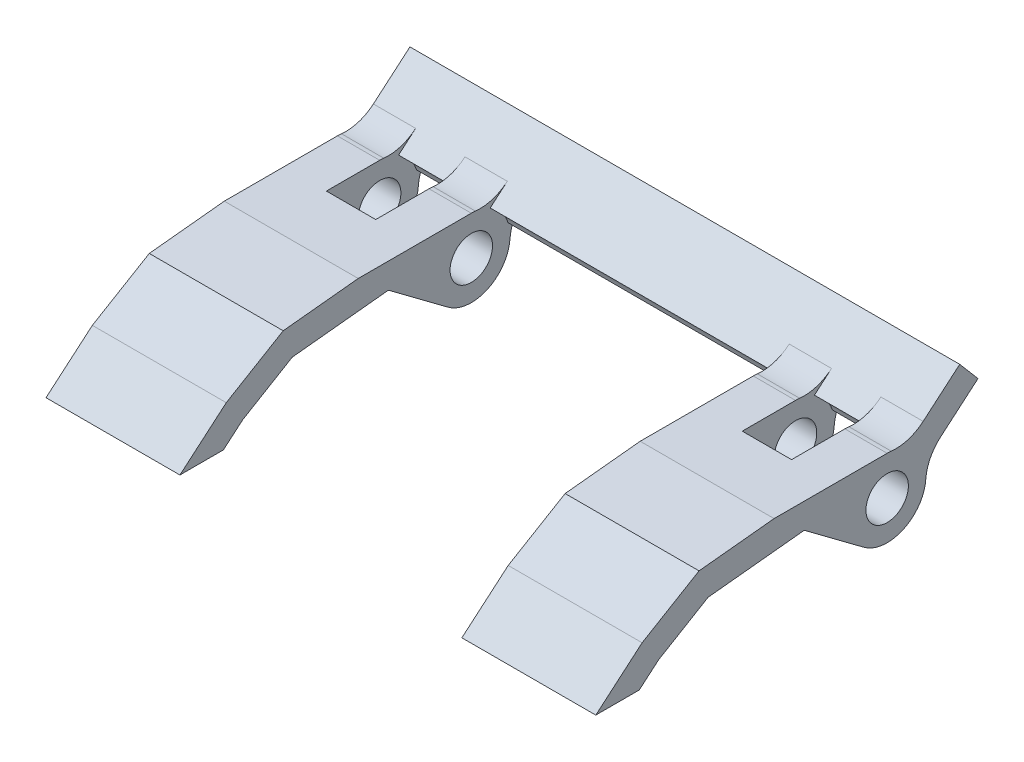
ISO-10303-21;
HEADER;
FILE_DESCRIPTION(('STEP AP214'),'2;1');
FILE_NAME('part.step','',(''),(''),'','','');
FILE_SCHEMA(('AUTOMOTIVE_DESIGN { 1 0 10303 214 1 1 1 1 }'));
ENDSEC;
DATA;
#1=APPLICATION_CONTEXT('core data for automotive mechanical design processes');
#2=APPLICATION_PROTOCOL_DEFINITION('international standard','automotive_design',2000,#1);
#3=PRODUCT_CONTEXT('',#1,'mechanical');
#4=PRODUCT('Part','Part','',(#3));
#5=PRODUCT_RELATED_PRODUCT_CATEGORY('part','',(#4));
#6=PRODUCT_DEFINITION_FORMATION('','',#4);
#7=PRODUCT_DEFINITION_CONTEXT('part definition',#1,'design');
#8=PRODUCT_DEFINITION('design','',#6,#7);
#9=PRODUCT_DEFINITION_SHAPE('','',#8);
#10=(LENGTH_UNIT() NAMED_UNIT(*) SI_UNIT(.MILLI.,.METRE.));
#11=(NAMED_UNIT(*) PLANE_ANGLE_UNIT() SI_UNIT($,.RADIAN.));
#12=(NAMED_UNIT(*) SI_UNIT($,.STERADIAN.) SOLID_ANGLE_UNIT());
#13=UNCERTAINTY_MEASURE_WITH_UNIT(LENGTH_MEASURE(1.E-05),#10,'distance_accuracy_value','');
#14=(GEOMETRIC_REPRESENTATION_CONTEXT(3) GLOBAL_UNCERTAINTY_ASSIGNED_CONTEXT((#13)) GLOBAL_UNIT_ASSIGNED_CONTEXT((#10,
#11,#12)) REPRESENTATION_CONTEXT('',''));
#15=CARTESIAN_POINT('',(0.,0.,0.));
#16=DIRECTION('',(0.,0.,1.));
#17=DIRECTION('',(1.,0.,0.));
#18=AXIS2_PLACEMENT_3D('',#15,#16,#17);
#19=CARTESIAN_POINT('',(82.5,24.25,-9.28957429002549));
#20=DIRECTION('',(0.,-1.,0.));
#21=DIRECTION('',(0.,0.,-1.));
#22=AXIS2_PLACEMENT_3D('',#19,#20,#21);
#23=PLANE('',#22);
#24=DIRECTION('',(-1.,0.,0.));
#25=VECTOR('',#24,1.);
#26=CARTESIAN_POINT('',(82.5,24.25,-1.26730312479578));
#27=LINE('',#26,#25);
#28=CARTESIAN_POINT('',(53.,24.25,-1.26730312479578));
#29=VERTEX_POINT('',#28);
#30=CARTESIAN_POINT('',(43.5,24.25,-1.26730312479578));
#31=VERTEX_POINT('',#30);
#32=EDGE_CURVE('E407',#29,#31,#27,.T.);
#33=ORIENTED_EDGE('',*,*,#32,.F.);
#34=DIRECTION('',(0.,0.,1.));
#35=VECTOR('',#34,1.);
#36=CARTESIAN_POINT('',(53.,24.25,11.3807985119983));
#37=LINE('',#36,#35);
#38=CARTESIAN_POINT('',(53.,24.25,-9.28957429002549));
#39=VERTEX_POINT('',#38);
#40=EDGE_CURVE('E741',#39,#29,#37,.T.);
#41=ORIENTED_EDGE('',*,*,#40,.F.);
#42=DIRECTION('',(-1.,0.,0.));
#43=VECTOR('',#42,1.);
#44=CARTESIAN_POINT('',(82.5,24.25,-9.28957429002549));
#45=LINE('',#44,#43);
#46=CARTESIAN_POINT('',(50.,24.25,-9.28957429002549));
#47=VERTEX_POINT('',#46);
#48=EDGE_CURVE('E878',#39,#47,#45,.T.);
#49=ORIENTED_EDGE('',*,*,#48,.T.);
#50=DIRECTION('',(0.,0.,-1.));
#51=VECTOR('',#50,1.);
#52=CARTESIAN_POINT('',(50.,24.25,11.3807985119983));
#53=LINE('',#52,#51);
#54=CARTESIAN_POINT('',(50.,24.25,-5.50844831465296));
#55=VERTEX_POINT('',#54);
#56=EDGE_CURVE('E761',#55,#47,#53,.T.);
#57=ORIENTED_EDGE('',*,*,#56,.F.);
#58=DIRECTION('',(1.,0.,0.));
#59=VECTOR('',#58,1.);
#60=CARTESIAN_POINT('',(43.5,24.25,-5.50844831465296));
#61=LINE('',#60,#59);
#62=CARTESIAN_POINT('',(46.5,24.25,-5.50844831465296));
#63=VERTEX_POINT('',#62);
#64=EDGE_CURVE('E673',#63,#55,#61,.T.);
#65=ORIENTED_EDGE('',*,*,#64,.F.);
#66=DIRECTION('',(0.,0.,1.));
#67=VECTOR('',#66,1.);
#68=CARTESIAN_POINT('',(46.5,24.25,11.3807985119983));
#69=LINE('',#68,#67);
#70=CARTESIAN_POINT('',(46.5,24.25,-9.28957429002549));
#71=VERTEX_POINT('',#70);
#72=EDGE_CURVE('E770',#71,#63,#69,.T.);
#73=ORIENTED_EDGE('',*,*,#72,.F.);
#74=CARTESIAN_POINT('',(43.5,24.25,-9.28957429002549));
#75=VERTEX_POINT('',#74);
#76=EDGE_CURVE('E411',#71,#75,#45,.T.);
#77=ORIENTED_EDGE('',*,*,#76,.T.);
#78=DIRECTION('',(0.,0.,1.));
#79=VECTOR('',#78,1.);
#80=CARTESIAN_POINT('',(43.5,24.25,-9.28957429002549));
#81=LINE('',#80,#79);
#82=EDGE_CURVE('E562',#75,#31,#81,.T.);
#83=ORIENTED_EDGE('',*,*,#82,.T.);
#84=EDGE_LOOP('',(#33,#41,#49,#57,#65,#73,#77,#83));
#85=FACE_BOUND('',#84,.T.);
#86=ADVANCED_FACE('F35',(#85),#23,.F.);
#87=CARTESIAN_POINT('',(82.5,23.6999414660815,4.05499896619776));
#88=DIRECTION('',(0.,-0.994701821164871,-0.102802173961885));
#89=DIRECTION('',(0.,0.102802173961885,-0.994701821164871));
#90=AXIS2_PLACEMENT_3D('',#87,#88,#89);
#91=PLANE('',#90);
#92=DIRECTION('',(-1.,0.,0.));
#93=VECTOR('',#92,1.);
#94=CARTESIAN_POINT('',(82.5,23.6999414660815,4.05499896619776));
#95=LINE('',#94,#93);
#96=CARTESIAN_POINT('',(53.,23.6999414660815,4.05499896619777));
#97=VERTEX_POINT('',#96);
#98=CARTESIAN_POINT('',(43.5,23.6999414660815,4.05499896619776));
#99=VERTEX_POINT('',#98);
#100=EDGE_CURVE('E403',#97,#99,#95,.T.);
#101=ORIENTED_EDGE('',*,*,#100,.F.);
#102=DIRECTION('',(0.,0.102802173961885,-0.994701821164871));
#103=VECTOR('',#102,1.);
#104=CARTESIAN_POINT('',(53.,23.6999414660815,4.05499896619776));
#105=LINE('',#104,#103);
#106=EDGE_CURVE('E679',#97,#29,#105,.T.);
#107=ORIENTED_EDGE('',*,*,#106,.T.);
#108=ORIENTED_EDGE('',*,*,#32,.T.);
#109=DIRECTION('',(0.,-0.102802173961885,0.994701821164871));
#110=VECTOR('',#109,1.);
#111=CARTESIAN_POINT('',(43.5,23.6999414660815,4.05499896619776));
#112=LINE('',#111,#110);
#113=EDGE_CURVE('E566',#31,#99,#112,.T.);
#114=ORIENTED_EDGE('',*,*,#113,.T.);
#115=EDGE_LOOP('',(#101,#107,#108,#114));
#116=FACE_BOUND('',#115,.T.);
#117=ADVANCED_FACE('F885',(#116),#91,.F.);
#118=CARTESIAN_POINT('',(82.5,21.3011279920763,8.09320696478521));
#119=DIRECTION('',(0.,-0.859749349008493,-0.5107162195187));
#120=DIRECTION('',(0.,0.5107162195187,-0.859749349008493));
#121=AXIS2_PLACEMENT_3D('',#118,#119,#120);
#122=PLANE('',#121);
#123=DIRECTION('',(-1.,0.,0.));
#124=VECTOR('',#123,1.);
#125=CARTESIAN_POINT('',(82.5,21.3011279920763,8.09320696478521));
#126=LINE('',#125,#124);
#127=CARTESIAN_POINT('',(53.,21.3011279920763,8.09320696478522));
#128=VERTEX_POINT('',#127);
#129=CARTESIAN_POINT('',(43.5,21.3011279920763,8.09320696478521));
#130=VERTEX_POINT('',#129);
#131=EDGE_CURVE('E399',#128,#130,#126,.T.);
#132=ORIENTED_EDGE('',*,*,#131,.F.);
#133=DIRECTION('',(0.,0.5107162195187,-0.859749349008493));
#134=VECTOR('',#133,1.);
#135=CARTESIAN_POINT('',(53.,21.3011279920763,8.09320696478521));
#136=LINE('',#135,#134);
#137=EDGE_CURVE('E888',#128,#97,#136,.T.);
#138=ORIENTED_EDGE('',*,*,#137,.T.);
#139=ORIENTED_EDGE('',*,*,#100,.T.);
#140=DIRECTION('',(0.,-0.5107162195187,0.859749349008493));
#141=VECTOR('',#140,1.);
#142=CARTESIAN_POINT('',(43.5,21.3011279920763,8.09320696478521));
#143=LINE('',#142,#141);
#144=EDGE_CURVE('E569',#99,#130,#143,.T.);
#145=ORIENTED_EDGE('',*,*,#144,.T.);
#146=EDGE_LOOP('',(#132,#138,#139,#145));
#147=FACE_BOUND('',#146,.T.);
#148=ADVANCED_FACE('F921',(#147),#122,.F.);
#149=CARTESIAN_POINT('',(82.5,18.5,11.3807985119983));
#150=DIRECTION('',(0.,-0.761176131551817,-0.648545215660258));
#151=DIRECTION('',(0.,0.648545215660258,-0.761176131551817));
#152=AXIS2_PLACEMENT_3D('',#149,#150,#151);
#153=PLANE('',#152);
#154=DIRECTION('',(-1.,0.,0.));
#155=VECTOR('',#154,1.);
#156=CARTESIAN_POINT('',(82.5,18.5,11.3807985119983));
#157=LINE('',#156,#155);
#158=CARTESIAN_POINT('',(53.,18.5,11.3807985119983));
#159=VERTEX_POINT('',#158);
#160=CARTESIAN_POINT('',(43.5,18.5,11.3807985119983));
#161=VERTEX_POINT('',#160);
#162=EDGE_CURVE('E391',#159,#161,#157,.T.);
#163=ORIENTED_EDGE('',*,*,#162,.F.);
#164=DIRECTION('',(0.,0.648545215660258,-0.761176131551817));
#165=VECTOR('',#164,1.);
#166=CARTESIAN_POINT('',(53.,18.5,11.3807985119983));
#167=LINE('',#166,#165);
#168=EDGE_CURVE('E889',#159,#128,#167,.T.);
#169=ORIENTED_EDGE('',*,*,#168,.T.);
#170=ORIENTED_EDGE('',*,*,#131,.T.);
#171=DIRECTION('',(0.,-0.648545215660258,0.761176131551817));
#172=VECTOR('',#171,1.);
#173=CARTESIAN_POINT('',(43.5,18.5,11.3807985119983));
#174=LINE('',#173,#172);
#175=EDGE_CURVE('E572',#130,#161,#174,.T.);
#176=ORIENTED_EDGE('',*,*,#175,.T.);
#177=EDGE_LOOP('',(#163,#169,#170,#176));
#178=FACE_BOUND('',#177,.T.);
#179=ADVANCED_FACE('F920',(#178),#153,.F.);
#180=CARTESIAN_POINT('',(82.5,18.5,11.3807985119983));
#181=DIRECTION('',(0.,1.,0.));
#182=DIRECTION('',(0.,0.,1.));
#183=AXIS2_PLACEMENT_3D('',#180,#181,#182);
#184=PLANE('',#183);
#185=DIRECTION('',(-1.,0.,0.));
#186=VECTOR('',#185,1.);
#187=CARTESIAN_POINT('',(82.5,18.5,8.29697343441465));
#188=LINE('',#187,#186);
#189=CARTESIAN_POINT('',(53.,18.5,8.29697343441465));
#190=VERTEX_POINT('',#189);
#191=CARTESIAN_POINT('',(43.5,18.5,8.29697343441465));
#192=VERTEX_POINT('',#191);
#193=EDGE_CURVE('E392',#190,#192,#188,.T.);
#194=ORIENTED_EDGE('',*,*,#193,.F.);
#195=DIRECTION('',(0.,0.,-1.));
#196=VECTOR('',#195,1.);
#197=CARTESIAN_POINT('',(53.,18.5,-5.52608082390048));
#198=LINE('',#197,#196);
#199=EDGE_CURVE('E387',#159,#190,#198,.T.);
#200=ORIENTED_EDGE('',*,*,#199,.F.);
#201=ORIENTED_EDGE('',*,*,#162,.T.);
#202=DIRECTION('',(0.,0.,-1.));
#203=VECTOR('',#202,1.);
#204=CARTESIAN_POINT('',(43.5,18.5,11.3807985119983));
#205=LINE('',#204,#203);
#206=EDGE_CURVE('E575',#161,#192,#205,.T.);
#207=ORIENTED_EDGE('',*,*,#206,.T.);
#208=EDGE_LOOP('',(#194,#200,#201,#207));
#209=FACE_BOUND('',#208,.T.);
#210=ADVANCED_FACE('F916',(#209),#184,.F.);
#211=CARTESIAN_POINT('',(82.5,18.5,8.29697343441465));
#212=DIRECTION('',(0.,0.761176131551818,0.648545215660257));
#213=DIRECTION('',(0.,-0.648545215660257,0.761176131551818));
#214=AXIS2_PLACEMENT_3D('',#211,#212,#213);
#215=PLANE('',#214);
#216=DIRECTION('',(-1.,0.,0.));
#217=VECTOR('',#216,1.);
#218=CARTESIAN_POINT('',(82.5,19.6684827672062,6.92556374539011));
#219=LINE('',#218,#217);
#220=CARTESIAN_POINT('',(53.,19.6684827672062,6.92556374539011));
#221=VERTEX_POINT('',#220);
#222=CARTESIAN_POINT('',(43.5,19.6684827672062,6.92556374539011));
#223=VERTEX_POINT('',#222);
#224=EDGE_CURVE('E614',#221,#223,#219,.T.);
#225=ORIENTED_EDGE('',*,*,#224,.F.);
#226=DIRECTION('',(0.,-0.648545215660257,0.761176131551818));
#227=VECTOR('',#226,1.);
#228=CARTESIAN_POINT('',(53.,18.5,8.29697343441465));
#229=LINE('',#228,#227);
#230=EDGE_CURVE('E893',#221,#190,#229,.T.);
#231=ORIENTED_EDGE('',*,*,#230,.T.);
#232=ORIENTED_EDGE('',*,*,#193,.T.);
#233=DIRECTION('',(0.,0.648545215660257,-0.761176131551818));
#234=VECTOR('',#233,1.);
#235=CARTESIAN_POINT('',(43.5,18.5,8.29697343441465));
#236=LINE('',#235,#234);
#237=EDGE_CURVE('E578',#192,#223,#236,.T.);
#238=ORIENTED_EDGE('',*,*,#237,.T.);
#239=EDGE_LOOP('',(#225,#231,#232,#238));
#240=FACE_BOUND('',#239,.T.);
#241=ADVANCED_FACE('F915',(#240),#215,.F.);
#242=CARTESIAN_POINT('',(82.5,19.6684827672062,6.92556374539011));
#243=DIRECTION('',(0.,0.859749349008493,0.510716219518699));
#244=DIRECTION('',(0.,-0.510716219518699,0.859749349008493));
#245=AXIS2_PLACEMENT_3D('',#242,#243,#244);
#246=PLANE('',#245);
#247=DIRECTION('',(-1.,0.,0.));
#248=VECTOR('',#247,1.);
#249=CARTESIAN_POINT('',(82.5,21.7557635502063,3.41179577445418));
#250=LINE('',#249,#248);
#251=CARTESIAN_POINT('',(53.,21.7557635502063,3.41179577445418));
#252=VERTEX_POINT('',#251);
#253=CARTESIAN_POINT('',(43.5,21.7557635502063,3.41179577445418));
#254=VERTEX_POINT('',#253);
#255=EDGE_CURVE('E610',#252,#254,#250,.T.);
#256=ORIENTED_EDGE('',*,*,#255,.F.);
#257=DIRECTION('',(0.,-0.510716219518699,0.859749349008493));
#258=VECTOR('',#257,1.);
#259=CARTESIAN_POINT('',(53.,19.6684827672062,6.92556374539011));
#260=LINE('',#259,#258);
#261=EDGE_CURVE('E898',#252,#221,#260,.T.);
#262=ORIENTED_EDGE('',*,*,#261,.T.);
#263=ORIENTED_EDGE('',*,*,#224,.T.);
#264=DIRECTION('',(0.,0.510716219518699,-0.859749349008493));
#265=VECTOR('',#264,1.);
#266=CARTESIAN_POINT('',(43.5,19.6684827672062,6.92556374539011));
#267=LINE('',#266,#265);
#268=EDGE_CURVE('E581',#223,#254,#267,.T.);
#269=ORIENTED_EDGE('',*,*,#268,.T.);
#270=EDGE_LOOP('',(#256,#262,#263,#269));
#271=FACE_BOUND('',#270,.T.);
#272=ADVANCED_FACE('F631',(#271),#246,.F.);
#273=CARTESIAN_POINT('',(82.5,21.7557635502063,3.41179577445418));
#274=DIRECTION('',(0.,0.994701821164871,0.102802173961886));
#275=DIRECTION('',(0.,-0.102802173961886,0.994701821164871));
#276=AXIS2_PLACEMENT_3D('',#273,#274,#275);
#277=PLANE('',#276);
#278=DIRECTION('',(-1.,0.,0.));
#279=VECTOR('',#278,1.);
#280=CARTESIAN_POINT('',(82.5,22.4606199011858,-3.40831190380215));
#281=LINE('',#280,#279);
#282=CARTESIAN_POINT('',(53.,22.4606199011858,-3.40831190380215));
#283=VERTEX_POINT('',#282);
#284=CARTESIAN_POINT('',(50.,22.4606199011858,-3.40831190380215));
#285=VERTEX_POINT('',#284);
#286=EDGE_CURVE('E645',#283,#285,#281,.T.);
#287=ORIENTED_EDGE('',*,*,#286,.F.);
#288=DIRECTION('',(0.,-0.102802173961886,0.994701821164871));
#289=VECTOR('',#288,1.);
#290=CARTESIAN_POINT('',(53.,21.7557635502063,3.41179577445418));
#291=LINE('',#290,#289);
#292=EDGE_CURVE('E627',#283,#252,#291,.T.);
#293=ORIENTED_EDGE('',*,*,#292,.T.);
#294=ORIENTED_EDGE('',*,*,#255,.T.);
#295=DIRECTION('',(0.,0.102802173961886,-0.99470182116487));
#296=VECTOR('',#295,1.);
#297=CARTESIAN_POINT('',(43.5,21.7557635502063,3.41179577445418));
#298=LINE('',#297,#296);
#299=CARTESIAN_POINT('',(43.5,22.4606199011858,-3.40831190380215));
#300=VERTEX_POINT('',#299);
#301=EDGE_CURVE('E584',#254,#300,#298,.T.);
#302=ORIENTED_EDGE('',*,*,#301,.T.);
#303=CARTESIAN_POINT('',(46.5,22.4606199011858,-3.40831190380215));
#304=VERTEX_POINT('',#303);
#305=EDGE_CURVE('E606',#304,#300,#281,.T.);
#306=ORIENTED_EDGE('',*,*,#305,.F.);
#307=DIRECTION('',(1.,0.,0.));
#308=VECTOR('',#307,1.);
#309=CARTESIAN_POINT('',(43.5,22.4606199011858,-3.40831190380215));
#310=LINE('',#309,#308);
#311=EDGE_CURVE('E672',#304,#285,#310,.T.);
#312=ORIENTED_EDGE('',*,*,#311,.T.);
#313=EDGE_LOOP('',(#287,#293,#294,#302,#306,#312));
#314=FACE_BOUND('',#313,.T.);
#315=ADVANCED_FACE('F623',(#314),#277,.F.);
#316=CARTESIAN_POINT('',(82.5,21.5,-9.28957429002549));
#317=DIRECTION('',(-1.,0.,0.));
#318=DIRECTION('',(0.,0.,1.));
#319=AXIS2_PLACEMENT_3D('',#316,#317,#318);
#320=CYLINDRICAL_SURFACE('',#319,2.75);
#321=CARTESIAN_POINT('',(82.5,21.5,-9.28957429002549));
#322=DIRECTION('',(1.,0.,0.));
#323=DIRECTION('',(0.,0.,-1.));
#324=AXIS2_PLACEMENT_3D('',#321,#322,#323);
#325=CIRCLE('',#324,2.75);
#326=CARTESIAN_POINT('',(82.5,24.2345900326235,-9.58029297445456));
#327=VERTEX_POINT('',#326);
#328=CARTESIAN_POINT('',(82.5,24.25,-9.28957429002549));
#329=VERTEX_POINT('',#328);
#330=EDGE_CURVE('E600',#327,#329,#325,.T.);
#331=ORIENTED_EDGE('',*,*,#330,.F.);
#332=DIRECTION('',(-1.,0.,0.));
#333=VECTOR('',#332,1.);
#334=CARTESIAN_POINT('',(82.5,24.2345900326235,-9.58029297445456));
#335=LINE('',#334,#333);
#336=CARTESIAN_POINT('',(79.5,24.2345900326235,-9.58029297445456));
#337=VERTEX_POINT('',#336);
#338=EDGE_CURVE('E420',#327,#337,#335,.T.);
#339=ORIENTED_EDGE('',*,*,#338,.T.);
#340=CARTESIAN_POINT('',(79.5,21.5,-9.28957429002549));
#341=DIRECTION('',(1.,0.,0.));
#342=DIRECTION('',(0.,0.,-1.));
#343=AXIS2_PLACEMENT_3D('',#340,#341,#342);
#344=CIRCLE('',#343,2.75);
#345=CARTESIAN_POINT('',(79.5,24.25,-9.28957429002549));
#346=VERTEX_POINT('',#345);
#347=EDGE_CURVE('E717',#346,#337,#344,.F.);
#348=ORIENTED_EDGE('',*,*,#347,.F.);
#349=EDGE_CURVE('E412',#329,#346,#45,.T.);
#350=ORIENTED_EDGE('',*,*,#349,.F.);
#351=EDGE_LOOP('',(#331,#339,#348,#350));
#352=FACE_BOUND('',#351,.T.);
#353=ADVANCED_FACE('F810',(#352),#320,.T.);
#354=CARTESIAN_POINT('',(82.5,22.4606199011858,-3.40831190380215));
#355=DIRECTION('',(0.,0.801163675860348,-0.598445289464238));
#356=DIRECTION('',(0.,0.598445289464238,0.801163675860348));
#357=AXIS2_PLACEMENT_3D('',#354,#355,#356);
#358=PLANE('',#357);
#359=CARTESIAN_POINT('',(82.5,22.4606199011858,-3.40831190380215));
#360=VERTEX_POINT('',#359);
#361=CARTESIAN_POINT('',(79.5,22.4606199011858,-3.40831190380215));
#362=VERTEX_POINT('',#361);
#363=EDGE_CURVE('E608',#360,#362,#281,.T.);
#364=ORIENTED_EDGE('',*,*,#363,.T.);
#365=DIRECTION('',(0.,0.598445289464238,0.801163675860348));
#366=VECTOR('',#365,1.);
#367=CARTESIAN_POINT('',(79.5,31.2288078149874,8.33002706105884));
#368=LINE('',#367,#366);
#369=CARTESIAN_POINT('',(79.5,19.2967998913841,-7.64384974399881));
#370=VERTEX_POINT('',#369);
#371=EDGE_CURVE('E533',#370,#362,#368,.T.);
#372=ORIENTED_EDGE('',*,*,#371,.F.);
#373=DIRECTION('',(-1.,0.,0.));
#374=VECTOR('',#373,1.);
#375=CARTESIAN_POINT('',(82.5,19.2967998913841,-7.64384974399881));
#376=LINE('',#375,#374);
#377=CARTESIAN_POINT('',(82.5,19.2967998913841,-7.64384974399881));
#378=VERTEX_POINT('',#377);
#379=EDGE_CURVE('E532',#378,#370,#376,.T.);
#380=ORIENTED_EDGE('',*,*,#379,.F.);
#381=DIRECTION('',(0.,-0.598445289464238,-0.801163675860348));
#382=VECTOR('',#381,1.);
#383=CARTESIAN_POINT('',(82.5,22.4606199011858,-3.40831190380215));
#384=LINE('',#383,#382);
#385=EDGE_CURVE('E553',#360,#378,#384,.T.);
#386=ORIENTED_EDGE('',*,*,#385,.F.);
#387=EDGE_LOOP('',(#364,#372,#380,#386));
#388=FACE_BOUND('',#387,.T.);
#389=ADVANCED_FACE('F798',(#388),#358,.F.);
#390=CARTESIAN_POINT('',(82.5,21.5,-9.28957429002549));
#391=DIRECTION('',(-1.,0.,0.));
#392=DIRECTION('',(0.,0.,1.));
#393=AXIS2_PLACEMENT_3D('',#390,#391,#392);
#394=CYLINDRICAL_SURFACE('',#393,2.74999999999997);
#395=CARTESIAN_POINT('',(79.5,21.5,-9.28957429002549));
#396=DIRECTION('',(1.,0.,0.));
#397=DIRECTION('',(0.,0.,-1.));
#398=AXIS2_PLACEMENT_3D('',#395,#396,#397);
#399=CIRCLE('',#398,2.74999999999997);
#400=CARTESIAN_POINT('',(79.5,21.2970379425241,-12.0320743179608));
#401=VERTEX_POINT('',#400);
#402=EDGE_CURVE('E520',#401,#370,#399,.F.);
#403=ORIENTED_EDGE('',*,*,#402,.F.);
#404=DIRECTION('',(-1.,0.,0.));
#405=VECTOR('',#404,1.);
#406=CARTESIAN_POINT('',(82.5,21.2970379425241,-12.0320743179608));
#407=LINE('',#406,#405);
#408=CARTESIAN_POINT('',(82.5,21.2970379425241,-12.0320743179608));
#409=VERTEX_POINT('',#408);
#410=EDGE_CURVE('E487',#401,#409,#407,.F.);
#411=ORIENTED_EDGE('',*,*,#410,.T.);
#412=CARTESIAN_POINT('',(82.5,21.5,-9.28957429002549));
#413=DIRECTION('',(1.,0.,0.));
#414=DIRECTION('',(0.,0.,-1.));
#415=AXIS2_PLACEMENT_3D('',#412,#413,#414);
#416=CIRCLE('',#415,2.74999999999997);
#417=EDGE_CURVE('E543',#378,#409,#416,.T.);
#418=ORIENTED_EDGE('',*,*,#417,.F.);
#419=ORIENTED_EDGE('',*,*,#379,.T.);
#420=EDGE_LOOP('',(#403,#411,#418,#419));
#421=FACE_BOUND('',#420,.T.);
#422=ADVANCED_FACE('F528',(#421),#394,.T.);
#423=CARTESIAN_POINT('',(82.5,21.5,-9.28957429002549));
#424=DIRECTION('',(-1.,0.,0.));
#425=DIRECTION('',(0.,0.,1.));
#426=AXIS2_PLACEMENT_3D('',#423,#424,#425);
#427=CYLINDRICAL_SURFACE('',#426,1.50576245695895);
#428=CARTESIAN_POINT('',(79.5,21.5,-9.28957429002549));
#429=DIRECTION('',(1.,0.,0.));
#430=DIRECTION('',(0.,0.,-1.));
#431=AXIS2_PLACEMENT_3D('',#428,#429,#430);
#432=CIRCLE('',#431,1.50576245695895);
#433=CARTESIAN_POINT('',(79.5,21.5,-10.7953367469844));
#434=VERTEX_POINT('',#433);
#435=EDGE_CURVE('E534',#434,#434,#432,.F.);
#436=ORIENTED_EDGE('',*,*,#435,.T.);
#437=EDGE_LOOP('',(#436));
#438=FACE_BOUND('',#437,.T.);
#439=CARTESIAN_POINT('',(82.5,21.5,-9.28957429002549));
#440=DIRECTION('',(1.,0.,0.));
#441=DIRECTION('',(0.,0.,-1.));
#442=AXIS2_PLACEMENT_3D('',#439,#440,#441);
#443=CIRCLE('',#442,1.50576245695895);
#444=CARTESIAN_POINT('',(82.5,21.5,-10.7953367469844));
#445=VERTEX_POINT('',#444);
#446=EDGE_CURVE('E563',#445,#445,#443,.T.);
#447=ORIENTED_EDGE('',*,*,#446,.T.);
#448=EDGE_LOOP('',(#447));
#449=FACE_BOUND('',#448,.T.);
#450=ADVANCED_FACE('F967',(#438,#449),#427,.F.);
#451=CARTESIAN_POINT('',(53.,21.5,-9.28957429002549));
#452=DIRECTION('',(-1.,0.,0.));
#453=DIRECTION('',(0.,0.,1.));
#454=AXIS2_PLACEMENT_3D('',#451,#452,#453);
#455=CIRCLE('',#454,2.75);
#456=CARTESIAN_POINT('',(53.,24.2345900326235,-9.58029297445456));
#457=VERTEX_POINT('',#456);
#458=EDGE_CURVE('E743',#457,#39,#455,.F.);
#459=ORIENTED_EDGE('',*,*,#458,.F.);
#460=DIRECTION('',(-1.,0.,0.));
#461=VECTOR('',#460,1.);
#462=CARTESIAN_POINT('',(82.5,24.2345900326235,-9.58029297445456));
#463=LINE('',#462,#461);
#464=CARTESIAN_POINT('',(50.,24.2345900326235,-9.58029297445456));
#465=VERTEX_POINT('',#464);
#466=EDGE_CURVE('E452',#457,#465,#463,.T.);
#467=ORIENTED_EDGE('',*,*,#466,.T.);
#468=CARTESIAN_POINT('',(50.,21.5,-9.28957429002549));
#469=DIRECTION('',(1.,0.,0.));
#470=DIRECTION('',(0.,0.,-1.));
#471=AXIS2_PLACEMENT_3D('',#468,#469,#470);
#472=CIRCLE('',#471,2.75);
#473=EDGE_CURVE('E763',#47,#465,#472,.F.);
#474=ORIENTED_EDGE('',*,*,#473,.F.);
#475=ORIENTED_EDGE('',*,*,#48,.F.);
#476=EDGE_LOOP('',(#459,#467,#474,#475));
#477=FACE_BOUND('',#476,.T.);
#478=ADVANCED_FACE('F876',(#477),#320,.T.);
#479=CARTESIAN_POINT('',(53.,19.2967998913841,-7.64384974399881));
#480=VERTEX_POINT('',#479);
#481=CARTESIAN_POINT('',(50.,19.2967998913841,-7.64384974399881));
#482=VERTEX_POINT('',#481);
#483=EDGE_CURVE('E1479',#480,#482,#376,.T.);
#484=ORIENTED_EDGE('',*,*,#483,.F.);
#485=DIRECTION('',(0.,-0.598445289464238,-0.801163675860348));
#486=VECTOR('',#485,1.);
#487=CARTESIAN_POINT('',(53.,31.2288078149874,8.33002706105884));
#488=LINE('',#487,#486);
#489=EDGE_CURVE('E739',#283,#480,#488,.T.);
#490=ORIENTED_EDGE('',*,*,#489,.F.);
#491=ORIENTED_EDGE('',*,*,#286,.T.);
#492=DIRECTION('',(0.,0.598445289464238,0.801163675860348));
#493=VECTOR('',#492,1.);
#494=CARTESIAN_POINT('',(50.,31.2288078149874,8.33002706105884));
#495=LINE('',#494,#493);
#496=EDGE_CURVE('E759',#482,#285,#495,.T.);
#497=ORIENTED_EDGE('',*,*,#496,.F.);
#498=EDGE_LOOP('',(#484,#490,#491,#497));
#499=FACE_BOUND('',#498,.T.);
#500=ADVANCED_FACE('F962',(#499),#358,.F.);
#501=CARTESIAN_POINT('',(50.,21.5,-9.28957429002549));
#502=DIRECTION('',(1.,0.,0.));
#503=DIRECTION('',(0.,0.,-1.));
#504=AXIS2_PLACEMENT_3D('',#501,#502,#503);
#505=CIRCLE('',#504,2.74999999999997);
#506=CARTESIAN_POINT('',(50.,21.2970379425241,-12.0320743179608));
#507=VERTEX_POINT('',#506);
#508=EDGE_CURVE('E757',#507,#482,#505,.F.);
#509=ORIENTED_EDGE('',*,*,#508,.F.);
#510=DIRECTION('',(-1.,0.,0.));
#511=VECTOR('',#510,1.);
#512=CARTESIAN_POINT('',(82.5,21.2970379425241,-12.0320743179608));
#513=LINE('',#512,#511);
#514=CARTESIAN_POINT('',(53.,21.2970379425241,-12.0320743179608));
#515=VERTEX_POINT('',#514);
#516=EDGE_CURVE('E483',#507,#515,#513,.F.);
#517=ORIENTED_EDGE('',*,*,#516,.T.);
#518=CARTESIAN_POINT('',(53.,21.5,-9.28957429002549));
#519=DIRECTION('',(-1.,0.,0.));
#520=DIRECTION('',(0.,0.,1.));
#521=AXIS2_PLACEMENT_3D('',#518,#519,#520);
#522=CIRCLE('',#521,2.74999999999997);
#523=EDGE_CURVE('E732',#480,#515,#522,.F.);
#524=ORIENTED_EDGE('',*,*,#523,.F.);
#525=ORIENTED_EDGE('',*,*,#483,.T.);
#526=EDGE_LOOP('',(#509,#517,#524,#525));
#527=FACE_BOUND('',#526,.T.);
#528=ADVANCED_FACE('F963',(#527),#394,.T.);
#529=CARTESIAN_POINT('',(53.,21.5,-9.28957429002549));
#530=DIRECTION('',(-1.,0.,0.));
#531=DIRECTION('',(0.,0.,1.));
#532=AXIS2_PLACEMENT_3D('',#529,#530,#531);
#533=CIRCLE('',#532,1.50576245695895);
#534=CARTESIAN_POINT('',(53.,21.5,-7.78381183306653));
#535=VERTEX_POINT('',#534);
#536=EDGE_CURVE('E736',#535,#535,#533,.F.);
#537=ORIENTED_EDGE('',*,*,#536,.T.);
#538=EDGE_LOOP('',(#537));
#539=FACE_BOUND('',#538,.T.);
#540=CARTESIAN_POINT('',(50.,21.5,-9.28957429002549));
#541=DIRECTION('',(1.,0.,0.));
#542=DIRECTION('',(0.,0.,-1.));
#543=AXIS2_PLACEMENT_3D('',#540,#541,#542);
#544=CIRCLE('',#543,1.50576245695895);
#545=CARTESIAN_POINT('',(50.,21.5,-10.7953367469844));
#546=VERTEX_POINT('',#545);
#547=EDGE_CURVE('E754',#546,#546,#544,.F.);
#548=ORIENTED_EDGE('',*,*,#547,.T.);
#549=EDGE_LOOP('',(#548));
#550=FACE_BOUND('',#549,.T.);
#551=ADVANCED_FACE('F954',(#539,#550),#427,.F.);
#552=CARTESIAN_POINT('',(76.,21.5,-9.28957429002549));
#553=DIRECTION('',(-1.,0.,0.));
#554=DIRECTION('',(0.,0.,1.));
#555=AXIS2_PLACEMENT_3D('',#552,#553,#554);
#556=CIRCLE('',#555,2.75);
#557=CARTESIAN_POINT('',(76.,24.2345900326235,-9.58029297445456));
#558=VERTEX_POINT('',#557);
#559=CARTESIAN_POINT('',(76.,24.25,-9.28957429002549));
#560=VERTEX_POINT('',#559);
#561=EDGE_CURVE('E720',#558,#560,#556,.F.);
#562=ORIENTED_EDGE('',*,*,#561,.F.);
#563=DIRECTION('',(-1.,0.,0.));
#564=VECTOR('',#563,1.);
#565=CARTESIAN_POINT('',(82.5,24.2345900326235,-9.58029297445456));
#566=LINE('',#565,#564);
#567=CARTESIAN_POINT('',(73.,24.2345900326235,-9.58029297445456));
#568=VERTEX_POINT('',#567);
#569=EDGE_CURVE('E449',#558,#568,#566,.T.);
#570=ORIENTED_EDGE('',*,*,#569,.T.);
#571=CARTESIAN_POINT('',(73.,21.5,-9.28957429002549));
#572=DIRECTION('',(1.,0.,0.));
#573=DIRECTION('',(0.,0.,-1.));
#574=AXIS2_PLACEMENT_3D('',#571,#572,#573);
#575=CIRCLE('',#574,2.75);
#576=CARTESIAN_POINT('',(73.,24.25,-9.28957429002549));
#577=VERTEX_POINT('',#576);
#578=EDGE_CURVE('E745',#577,#568,#575,.F.);
#579=ORIENTED_EDGE('',*,*,#578,.F.);
#580=EDGE_CURVE('E416',#560,#577,#45,.T.);
#581=ORIENTED_EDGE('',*,*,#580,.F.);
#582=EDGE_LOOP('',(#562,#570,#579,#581));
#583=FACE_BOUND('',#582,.T.);
#584=ADVANCED_FACE('F946',(#583),#320,.T.);
#585=CARTESIAN_POINT('',(76.,19.2967998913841,-7.64384974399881));
#586=VERTEX_POINT('',#585);
#587=CARTESIAN_POINT('',(73.,19.2967998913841,-7.64384974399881));
#588=VERTEX_POINT('',#587);
#589=EDGE_CURVE('E607',#586,#588,#376,.T.);
#590=ORIENTED_EDGE('',*,*,#589,.F.);
#591=DIRECTION('',(0.,-0.598445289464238,-0.801163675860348));
#592=VECTOR('',#591,1.);
#593=CARTESIAN_POINT('',(76.,31.2288078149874,8.33002706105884));
#594=LINE('',#593,#592);
#595=CARTESIAN_POINT('',(76.,22.4606199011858,-3.40831190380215));
#596=VERTEX_POINT('',#595);
#597=EDGE_CURVE('E658',#596,#586,#594,.T.);
#598=ORIENTED_EDGE('',*,*,#597,.F.);
#599=CARTESIAN_POINT('',(73.,22.4606199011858,-3.40831190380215));
#600=VERTEX_POINT('',#599);
#601=EDGE_CURVE('E611',#596,#600,#281,.T.);
#602=ORIENTED_EDGE('',*,*,#601,.T.);
#603=DIRECTION('',(0.,0.598445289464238,0.801163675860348));
#604=VECTOR('',#603,1.);
#605=CARTESIAN_POINT('',(73.,31.2288078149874,8.33002706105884));
#606=LINE('',#605,#604);
#607=EDGE_CURVE('E657',#588,#600,#606,.T.);
#608=ORIENTED_EDGE('',*,*,#607,.F.);
#609=EDGE_LOOP('',(#590,#598,#602,#608));
#610=FACE_BOUND('',#609,.T.);
#611=ADVANCED_FACE('F656',(#610),#358,.F.);
#612=CARTESIAN_POINT('',(73.,21.5,-9.28957429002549));
#613=DIRECTION('',(1.,0.,0.));
#614=DIRECTION('',(0.,0.,-1.));
#615=AXIS2_PLACEMENT_3D('',#612,#613,#614);
#616=CIRCLE('',#615,2.74999999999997);
#617=CARTESIAN_POINT('',(73.,21.2970379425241,-12.0320743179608));
#618=VERTEX_POINT('',#617);
#619=EDGE_CURVE('E730',#618,#588,#616,.F.);
#620=ORIENTED_EDGE('',*,*,#619,.F.);
#621=DIRECTION('',(-1.,0.,0.));
#622=VECTOR('',#621,1.);
#623=CARTESIAN_POINT('',(82.5,21.2970379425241,-12.0320743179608));
#624=LINE('',#623,#622);
#625=CARTESIAN_POINT('',(76.,21.2970379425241,-12.0320743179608));
#626=VERTEX_POINT('',#625);
#627=EDGE_CURVE('E485',#618,#626,#624,.F.);
#628=ORIENTED_EDGE('',*,*,#627,.T.);
#629=CARTESIAN_POINT('',(76.,21.5,-9.28957429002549));
#630=DIRECTION('',(-1.,0.,0.));
#631=DIRECTION('',(0.,0.,1.));
#632=AXIS2_PLACEMENT_3D('',#629,#630,#631);
#633=CIRCLE('',#632,2.74999999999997);
#634=EDGE_CURVE('E726',#586,#626,#633,.F.);
#635=ORIENTED_EDGE('',*,*,#634,.F.);
#636=ORIENTED_EDGE('',*,*,#589,.T.);
#637=EDGE_LOOP('',(#620,#628,#635,#636));
#638=FACE_BOUND('',#637,.T.);
#639=ADVANCED_FACE('F960',(#638),#394,.T.);
#640=CARTESIAN_POINT('',(76.,21.5,-9.28957429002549));
#641=DIRECTION('',(-1.,0.,0.));
#642=DIRECTION('',(0.,0.,1.));
#643=AXIS2_PLACEMENT_3D('',#640,#641,#642);
#644=CIRCLE('',#643,1.50576245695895);
#645=CARTESIAN_POINT('',(76.,21.5,-7.78381183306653));
#646=VERTEX_POINT('',#645);
#647=EDGE_CURVE('E711',#646,#646,#644,.F.);
#648=ORIENTED_EDGE('',*,*,#647,.T.);
#649=EDGE_LOOP('',(#648));
#650=FACE_BOUND('',#649,.T.);
#651=CARTESIAN_POINT('',(73.,21.5,-9.28957429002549));
#652=DIRECTION('',(1.,0.,0.));
#653=DIRECTION('',(0.,0.,-1.));
#654=AXIS2_PLACEMENT_3D('',#651,#652,#653);
#655=CIRCLE('',#654,1.50576245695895);
#656=CARTESIAN_POINT('',(73.,21.5,-10.7953367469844));
#657=VERTEX_POINT('',#656);
#658=EDGE_CURVE('E735',#657,#657,#655,.F.);
#659=ORIENTED_EDGE('',*,*,#658,.T.);
#660=EDGE_LOOP('',(#659));
#661=FACE_BOUND('',#660,.T.);
#662=ADVANCED_FACE('F966',(#650,#661),#427,.F.);
#663=CARTESIAN_POINT('',(82.5,21.5,-9.28957429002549));
#664=DIRECTION('',(1.,0.,0.));
#665=DIRECTION('',(0.,0.,-1.));
#666=AXIS2_PLACEMENT_3D('',#663,#664,#665);
#667=PLANE('',#666);
#668=DIRECTION('',(0.,0.,1.));
#669=VECTOR('',#668,1.);
#670=CARTESIAN_POINT('',(82.5,24.25,-9.28957429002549));
#671=LINE('',#670,#669);
#672=CARTESIAN_POINT('',(82.5,24.25,-1.26730312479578));
#673=VERTEX_POINT('',#672);
#674=EDGE_CURVE('E782',#329,#673,#671,.T.);
#675=ORIENTED_EDGE('',*,*,#674,.T.);
#676=DIRECTION('',(0.,-0.102802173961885,0.994701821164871));
#677=VECTOR('',#676,1.);
#678=CARTESIAN_POINT('',(82.5,23.6999414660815,4.05499896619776));
#679=LINE('',#678,#677);
#680=CARTESIAN_POINT('',(82.5,23.6999414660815,4.05499896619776));
#681=VERTEX_POINT('',#680);
#682=EDGE_CURVE('E784',#673,#681,#679,.T.);
#683=ORIENTED_EDGE('',*,*,#682,.T.);
#684=DIRECTION('',(0.,-0.5107162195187,0.859749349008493));
#685=VECTOR('',#684,1.);
#686=CARTESIAN_POINT('',(82.5,21.3011279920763,8.09320696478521));
#687=LINE('',#686,#685);
#688=CARTESIAN_POINT('',(82.5,21.3011279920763,8.09320696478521));
#689=VERTEX_POINT('',#688);
#690=EDGE_CURVE('E786',#681,#689,#687,.T.);
#691=ORIENTED_EDGE('',*,*,#690,.T.);
#692=DIRECTION('',(0.,-0.648545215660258,0.761176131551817));
#693=VECTOR('',#692,1.);
#694=CARTESIAN_POINT('',(82.5,18.5,11.3807985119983));
#695=LINE('',#694,#693);
#696=CARTESIAN_POINT('',(82.5,18.5,11.3807985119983));
#697=VERTEX_POINT('',#696);
#698=EDGE_CURVE('E788',#689,#697,#695,.T.);
#699=ORIENTED_EDGE('',*,*,#698,.T.);
#700=DIRECTION('',(0.,0.,-1.));
#701=VECTOR('',#700,1.);
#702=CARTESIAN_POINT('',(82.5,18.5,11.3807985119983));
#703=LINE('',#702,#701);
#704=CARTESIAN_POINT('',(82.5,18.5,8.29697343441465));
#705=VERTEX_POINT('',#704);
#706=EDGE_CURVE('E790',#697,#705,#703,.T.);
#707=ORIENTED_EDGE('',*,*,#706,.T.);
#708=DIRECTION('',(0.,0.648545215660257,-0.761176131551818));
#709=VECTOR('',#708,1.);
#710=CARTESIAN_POINT('',(82.5,18.5,8.29697343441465));
#711=LINE('',#710,#709);
#712=CARTESIAN_POINT('',(82.5,19.6684827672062,6.92556374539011));
#713=VERTEX_POINT('',#712);
#714=EDGE_CURVE('E390',#705,#713,#711,.T.);
#715=ORIENTED_EDGE('',*,*,#714,.T.);
#716=DIRECTION('',(0.,0.510716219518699,-0.859749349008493));
#717=VECTOR('',#716,1.);
#718=CARTESIAN_POINT('',(82.5,19.6684827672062,6.92556374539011));
#719=LINE('',#718,#717);
#720=CARTESIAN_POINT('',(82.5,21.7557635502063,3.41179577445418));
#721=VERTEX_POINT('',#720);
#722=EDGE_CURVE('E793',#713,#721,#719,.T.);
#723=ORIENTED_EDGE('',*,*,#722,.T.);
#724=DIRECTION('',(0.,0.102802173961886,-0.99470182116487));
#725=VECTOR('',#724,1.);
#726=CARTESIAN_POINT('',(82.5,21.7557635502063,3.41179577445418));
#727=LINE('',#726,#725);
#728=EDGE_CURVE('E795',#721,#360,#727,.T.);
#729=ORIENTED_EDGE('',*,*,#728,.T.);
#730=ORIENTED_EDGE('',*,*,#385,.T.);
#731=ORIENTED_EDGE('',*,*,#417,.T.);
#732=CARTESIAN_POINT('',(82.5,21.075624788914,-15.0238925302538));
#733=DIRECTION('',(1.,0.,0.));
#734=DIRECTION('',(0.,0.,-1.));
#735=AXIS2_PLACEMENT_3D('',#732,#733,#734);
#736=CIRCLE('',#735,3.);
#737=CARTESIAN_POINT('',(82.5,23.3592213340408,-13.0783368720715));
#738=VERTEX_POINT('',#737);
#739=EDGE_CURVE('E11',#409,#738,#736,.F.);
#740=ORIENTED_EDGE('',*,*,#739,.T.);
#741=DIRECTION('',(0.,0.648518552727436,-0.761198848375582));
#742=VECTOR('',#741,1.);
#743=CARTESIAN_POINT('',(82.5,25.6212151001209,-15.733352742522));
#744=LINE('',#743,#742);
#745=CARTESIAN_POINT('',(82.5,25.6212151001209,-15.733352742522));
#746=VERTEX_POINT('',#745);
#747=EDGE_CURVE('E541',#738,#746,#744,.T.);
#748=ORIENTED_EDGE('',*,*,#747,.T.);
#749=DIRECTION('',(0.,0.761198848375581,0.648518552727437));
#750=VECTOR('',#749,1.);
#751=CARTESIAN_POINT('',(82.5,27.143612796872,-14.4363156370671));
#752=LINE('',#751,#750);
#753=CARTESIAN_POINT('',(82.5,27.143612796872,-14.4363156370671));
#754=VERTEX_POINT('',#753);
#755=EDGE_CURVE('E549',#746,#754,#752,.T.);
#756=ORIENTED_EDGE('',*,*,#755,.T.);
#757=DIRECTION('',(0.,-0.648518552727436,0.761198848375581));
#758=VECTOR('',#757,1.);
#759=CARTESIAN_POINT('',(82.5,23.9010200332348,-10.6303213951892));
#760=LINE('',#759,#758);
#761=CARTESIAN_POINT('',(82.5,24.9341826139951,-11.8429962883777));
#762=VERTEX_POINT('',#761);
#763=EDGE_CURVE('E551',#754,#762,#760,.T.);
#764=ORIENTED_EDGE('',*,*,#763,.T.);
#765=CARTESIAN_POINT('',(82.5,27.2177791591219,-9.89744063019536));
#766=DIRECTION('',(1.,0.,0.));
#767=DIRECTION('',(0.,0.,-1.));
#768=AXIS2_PLACEMENT_3D('',#765,#766,#767);
#769=CIRCLE('',#768,3.);
#770=EDGE_CURVE('E491',#762,#327,#769,.F.);
#771=ORIENTED_EDGE('',*,*,#770,.T.);
#772=ORIENTED_EDGE('',*,*,#330,.T.);
#773=EDGE_LOOP('',(#675,#683,#691,#699,#707,#715,#723,#729,#730,#731,#740,#748,#756,#764,#771,#772));
#774=FACE_BOUND('',#773,.T.);
#775=ORIENTED_EDGE('',*,*,#446,.F.);
#776=EDGE_LOOP('',(#775));
#777=FACE_BOUND('',#776,.T.);
#778=ADVANCED_FACE('F539',(#774,#777),#667,.T.);
#779=CARTESIAN_POINT('',(43.5,21.5,-9.28957429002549));
#780=DIRECTION('',(1.,0.,0.));
#781=DIRECTION('',(0.,0.,-1.));
#782=AXIS2_PLACEMENT_3D('',#779,#780,#781);
#783=PLANE('',#782);
#784=DIRECTION('',(0.,-0.598445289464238,-0.801163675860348));
#785=VECTOR('',#784,1.);
#786=CARTESIAN_POINT('',(43.5,22.4606199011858,-3.40831190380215));
#787=LINE('',#786,#785);
#788=CARTESIAN_POINT('',(43.5,19.2967998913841,-7.64384974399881));
#789=VERTEX_POINT('',#788);
#790=EDGE_CURVE('E587',#300,#789,#787,.T.);
#791=ORIENTED_EDGE('',*,*,#790,.F.);
#792=ORIENTED_EDGE('',*,*,#301,.F.);
#793=ORIENTED_EDGE('',*,*,#268,.F.);
#794=ORIENTED_EDGE('',*,*,#237,.F.);
#795=ORIENTED_EDGE('',*,*,#206,.F.);
#796=ORIENTED_EDGE('',*,*,#175,.F.);
#797=ORIENTED_EDGE('',*,*,#144,.F.);
#798=ORIENTED_EDGE('',*,*,#113,.F.);
#799=ORIENTED_EDGE('',*,*,#82,.F.);
#800=CARTESIAN_POINT('',(43.5,21.5,-9.28957429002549));
#801=DIRECTION('',(1.,0.,0.));
#802=DIRECTION('',(0.,0.,-1.));
#803=AXIS2_PLACEMENT_3D('',#800,#801,#802);
#804=CIRCLE('',#803,2.75);
#805=CARTESIAN_POINT('',(43.5,24.2345900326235,-9.58029297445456));
#806=VERTEX_POINT('',#805);
#807=EDGE_CURVE('E560',#806,#75,#804,.T.);
#808=ORIENTED_EDGE('',*,*,#807,.F.);
#809=CARTESIAN_POINT('',(43.5,27.2177791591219,-9.89744063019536));
#810=DIRECTION('',(1.,0.,0.));
#811=DIRECTION('',(0.,0.,-1.));
#812=AXIS2_PLACEMENT_3D('',#809,#810,#811);
#813=CIRCLE('',#812,3.);
#814=CARTESIAN_POINT('',(43.5,24.9341826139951,-11.8429962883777));
#815=VERTEX_POINT('',#814);
#816=EDGE_CURVE('E501',#806,#815,#813,.T.);
#817=ORIENTED_EDGE('',*,*,#816,.T.);
#818=DIRECTION('',(0.,-0.648518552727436,0.761198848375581));
#819=VECTOR('',#818,1.);
#820=CARTESIAN_POINT('',(43.5,23.9010200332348,-10.6303213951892));
#821=LINE('',#820,#819);
#822=CARTESIAN_POINT('',(43.5,27.143612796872,-14.4363156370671));
#823=VERTEX_POINT('',#822);
#824=EDGE_CURVE('E597',#823,#815,#821,.T.);
#825=ORIENTED_EDGE('',*,*,#824,.F.);
#826=DIRECTION('',(0.,0.761198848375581,0.648518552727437));
#827=VECTOR('',#826,1.);
#828=CARTESIAN_POINT('',(43.5,27.143612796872,-14.4363156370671));
#829=LINE('',#828,#827);
#830=CARTESIAN_POINT('',(43.5,25.6212151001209,-15.733352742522));
#831=VERTEX_POINT('',#830);
#832=EDGE_CURVE('E595',#831,#823,#829,.T.);
#833=ORIENTED_EDGE('',*,*,#832,.F.);
#834=DIRECTION('',(0.,0.648518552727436,-0.761198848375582));
#835=VECTOR('',#834,1.);
#836=CARTESIAN_POINT('',(43.5,25.6212151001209,-15.733352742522));
#837=LINE('',#836,#835);
#838=CARTESIAN_POINT('',(43.5,23.3592213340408,-13.0783368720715));
#839=VERTEX_POINT('',#838);
#840=EDGE_CURVE('E593',#839,#831,#837,.T.);
#841=ORIENTED_EDGE('',*,*,#840,.F.);
#842=CARTESIAN_POINT('',(43.5,21.075624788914,-15.0238925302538));
#843=DIRECTION('',(1.,0.,0.));
#844=DIRECTION('',(0.,0.,-1.));
#845=AXIS2_PLACEMENT_3D('',#842,#843,#844);
#846=CIRCLE('',#845,3.);
#847=CARTESIAN_POINT('',(43.5,21.2970379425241,-12.0320743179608));
#848=VERTEX_POINT('',#847);
#849=EDGE_CURVE('E505',#839,#848,#846,.T.);
#850=ORIENTED_EDGE('',*,*,#849,.T.);
#851=CARTESIAN_POINT('',(43.5,21.5,-9.28957429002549));
#852=DIRECTION('',(1.,0.,0.));
#853=DIRECTION('',(0.,0.,-1.));
#854=AXIS2_PLACEMENT_3D('',#851,#852,#853);
#855=CIRCLE('',#854,2.74999999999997);
#856=EDGE_CURVE('E590',#789,#848,#855,.T.);
#857=ORIENTED_EDGE('',*,*,#856,.F.);
#858=EDGE_LOOP('',(#791,#792,#793,#794,#795,#796,#797,#798,#799,#808,#817,#825,#833,#841,#850,#857));
#859=FACE_BOUND('',#858,.T.);
#860=CARTESIAN_POINT('',(43.5,21.5,-9.28957429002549));
#861=DIRECTION('',(1.,0.,0.));
#862=DIRECTION('',(0.,0.,-1.));
#863=AXIS2_PLACEMENT_3D('',#860,#861,#862);
#864=CIRCLE('',#863,1.50576245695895);
#865=CARTESIAN_POINT('',(43.5,21.5,-10.7953367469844));
#866=VERTEX_POINT('',#865);
#867=EDGE_CURVE('E776',#866,#866,#864,.T.);
#868=ORIENTED_EDGE('',*,*,#867,.T.);
#869=EDGE_LOOP('',(#868));
#870=FACE_BOUND('',#869,.T.);
#871=ADVANCED_FACE('F635',(#859,#870),#783,.F.);
#872=CARTESIAN_POINT('',(46.5,21.5,-9.28957429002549));
#873=DIRECTION('',(-1.,0.,0.));
#874=DIRECTION('',(0.,0.,1.));
#875=AXIS2_PLACEMENT_3D('',#872,#873,#874);
#876=CIRCLE('',#875,2.75);
#877=CARTESIAN_POINT('',(46.5,24.2345900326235,-9.58029297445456));
#878=VERTEX_POINT('',#877);
#879=EDGE_CURVE('E766',#878,#71,#876,.F.);
#880=ORIENTED_EDGE('',*,*,#879,.F.);
#881=DIRECTION('',(-1.,0.,0.));
#882=VECTOR('',#881,1.);
#883=CARTESIAN_POINT('',(82.5,24.2345900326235,-9.58029297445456));
#884=LINE('',#883,#882);
#885=EDGE_CURVE('E455',#878,#806,#884,.T.);
#886=ORIENTED_EDGE('',*,*,#885,.T.);
#887=ORIENTED_EDGE('',*,*,#807,.T.);
#888=ORIENTED_EDGE('',*,*,#76,.F.);
#889=EDGE_LOOP('',(#880,#886,#887,#888));
#890=FACE_BOUND('',#889,.T.);
#891=ADVANCED_FACE('F835',(#890),#320,.T.);
#892=DIRECTION('',(0.,0.,-1.));
#893=VECTOR('',#892,1.);
#894=CARTESIAN_POINT('',(73.,24.25,11.3807985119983));
#895=LINE('',#894,#893);
#896=CARTESIAN_POINT('',(73.,24.25,-1.26730312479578));
#897=VERTEX_POINT('',#896);
#898=EDGE_CURVE('E750',#897,#577,#895,.T.);
#899=ORIENTED_EDGE('',*,*,#898,.F.);
#900=EDGE_CURVE('E408',#673,#897,#27,.T.);
#901=ORIENTED_EDGE('',*,*,#900,.F.);
#902=ORIENTED_EDGE('',*,*,#674,.F.);
#903=ORIENTED_EDGE('',*,*,#349,.T.);
#904=DIRECTION('',(0.,0.,-1.));
#905=VECTOR('',#904,1.);
#906=CARTESIAN_POINT('',(79.5,24.25,11.3807985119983));
#907=LINE('',#906,#905);
#908=CARTESIAN_POINT('',(79.5,24.25,-5.50844831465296));
#909=VERTEX_POINT('',#908);
#910=EDGE_CURVE('E715',#909,#346,#907,.T.);
#911=ORIENTED_EDGE('',*,*,#910,.F.);
#912=CARTESIAN_POINT('',(76.,24.25,-5.50844831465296));
#913=VERTEX_POINT('',#912);
#914=EDGE_CURVE('E676',#913,#909,#61,.T.);
#915=ORIENTED_EDGE('',*,*,#914,.F.);
#916=DIRECTION('',(0.,0.,1.));
#917=VECTOR('',#916,1.);
#918=CARTESIAN_POINT('',(76.,24.25,11.3807985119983));
#919=LINE('',#918,#917);
#920=EDGE_CURVE('E724',#560,#913,#919,.T.);
#921=ORIENTED_EDGE('',*,*,#920,.F.);
#922=ORIENTED_EDGE('',*,*,#580,.T.);
#923=EDGE_LOOP('',(#899,#901,#902,#903,#911,#915,#921,#922));
#924=FACE_BOUND('',#923,.T.);
#925=ADVANCED_FACE('F802',(#924),#23,.F.);
#926=ORIENTED_EDGE('',*,*,#900,.T.);
#927=DIRECTION('',(0.,-0.102802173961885,0.994701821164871));
#928=VECTOR('',#927,1.);
#929=CARTESIAN_POINT('',(73.,23.6999414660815,4.05499896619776));
#930=LINE('',#929,#928);
#931=CARTESIAN_POINT('',(73.,23.6999414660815,4.05499896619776));
#932=VERTEX_POINT('',#931);
#933=EDGE_CURVE('E375',#897,#932,#930,.T.);
#934=ORIENTED_EDGE('',*,*,#933,.T.);
#935=EDGE_CURVE('E404',#681,#932,#95,.T.);
#936=ORIENTED_EDGE('',*,*,#935,.F.);
#937=ORIENTED_EDGE('',*,*,#682,.F.);
#938=EDGE_LOOP('',(#926,#934,#936,#937));
#939=FACE_BOUND('',#938,.T.);
#940=ADVANCED_FACE('F932',(#939),#91,.F.);
#941=ORIENTED_EDGE('',*,*,#935,.T.);
#942=DIRECTION('',(0.,-0.5107162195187,0.859749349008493));
#943=VECTOR('',#942,1.);
#944=CARTESIAN_POINT('',(73.,21.3011279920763,8.09320696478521));
#945=LINE('',#944,#943);
#946=CARTESIAN_POINT('',(73.,21.3011279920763,8.09320696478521));
#947=VERTEX_POINT('',#946);
#948=EDGE_CURVE('E903',#932,#947,#945,.T.);
#949=ORIENTED_EDGE('',*,*,#948,.T.);
#950=EDGE_CURVE('E400',#689,#947,#126,.T.);
#951=ORIENTED_EDGE('',*,*,#950,.F.);
#952=ORIENTED_EDGE('',*,*,#690,.F.);
#953=EDGE_LOOP('',(#941,#949,#951,#952));
#954=FACE_BOUND('',#953,.T.);
#955=ADVANCED_FACE('F924',(#954),#122,.F.);
#956=ORIENTED_EDGE('',*,*,#950,.T.);
#957=DIRECTION('',(0.,-0.648545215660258,0.761176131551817));
#958=VECTOR('',#957,1.);
#959=CARTESIAN_POINT('',(73.,18.5,11.3807985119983));
#960=LINE('',#959,#958);
#961=CARTESIAN_POINT('',(73.,18.5,11.3807985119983));
#962=VERTEX_POINT('',#961);
#963=EDGE_CURVE('E901',#947,#962,#960,.T.);
#964=ORIENTED_EDGE('',*,*,#963,.T.);
#965=EDGE_CURVE('E385',#697,#962,#157,.T.);
#966=ORIENTED_EDGE('',*,*,#965,.F.);
#967=ORIENTED_EDGE('',*,*,#698,.F.);
#968=EDGE_LOOP('',(#956,#964,#966,#967));
#969=FACE_BOUND('',#968,.T.);
#970=ADVANCED_FACE('F930',(#969),#153,.F.);
#971=ORIENTED_EDGE('',*,*,#965,.T.);
#972=DIRECTION('',(0.,0.,1.));
#973=VECTOR('',#972,1.);
#974=CARTESIAN_POINT('',(73.,18.5,-5.52608082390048));
#975=LINE('',#974,#973);
#976=CARTESIAN_POINT('',(73.,18.5,8.29697343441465));
#977=VERTEX_POINT('',#976);
#978=EDGE_CURVE('E367',#977,#962,#975,.T.);
#979=ORIENTED_EDGE('',*,*,#978,.F.);
#980=EDGE_CURVE('E382',#705,#977,#188,.T.);
#981=ORIENTED_EDGE('',*,*,#980,.F.);
#982=ORIENTED_EDGE('',*,*,#706,.F.);
#983=EDGE_LOOP('',(#971,#979,#981,#982));
#984=FACE_BOUND('',#983,.T.);
#985=ADVANCED_FACE('F380',(#984),#184,.F.);
#986=ORIENTED_EDGE('',*,*,#980,.T.);
#987=DIRECTION('',(0.,0.648545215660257,-0.761176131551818));
#988=VECTOR('',#987,1.);
#989=CARTESIAN_POINT('',(73.,18.5,8.29697343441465));
#990=LINE('',#989,#988);
#991=CARTESIAN_POINT('',(73.,19.6684827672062,6.92556374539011));
#992=VERTEX_POINT('',#991);
#993=EDGE_CURVE('E364',#977,#992,#990,.T.);
#994=ORIENTED_EDGE('',*,*,#993,.T.);
#995=EDGE_CURVE('E395',#713,#992,#219,.T.);
#996=ORIENTED_EDGE('',*,*,#995,.F.);
#997=ORIENTED_EDGE('',*,*,#714,.F.);
#998=EDGE_LOOP('',(#986,#994,#996,#997));
#999=FACE_BOUND('',#998,.T.);
#1000=ADVANCED_FACE('F389',(#999),#215,.F.);
#1001=ORIENTED_EDGE('',*,*,#995,.T.);
#1002=DIRECTION('',(0.,0.510716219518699,-0.859749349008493));
#1003=VECTOR('',#1002,1.);
#1004=CARTESIAN_POINT('',(73.,19.6684827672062,6.92556374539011));
#1005=LINE('',#1004,#1003);
#1006=CARTESIAN_POINT('',(73.,21.7557635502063,3.41179577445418));
#1007=VERTEX_POINT('',#1006);
#1008=EDGE_CURVE('E370',#992,#1007,#1005,.T.);
#1009=ORIENTED_EDGE('',*,*,#1008,.T.);
#1010=EDGE_CURVE('E612',#721,#1007,#250,.T.);
#1011=ORIENTED_EDGE('',*,*,#1010,.F.);
#1012=ORIENTED_EDGE('',*,*,#722,.F.);
#1013=EDGE_LOOP('',(#1001,#1009,#1011,#1012));
#1014=FACE_BOUND('',#1013,.T.);
#1015=ADVANCED_FACE('F1144',(#1014),#246,.F.);
#1016=ORIENTED_EDGE('',*,*,#1010,.T.);
#1017=DIRECTION('',(0.,0.102802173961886,-0.994701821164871));
#1018=VECTOR('',#1017,1.);
#1019=CARTESIAN_POINT('',(73.,21.7557635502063,3.41179577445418));
#1020=LINE('',#1019,#1018);
#1021=EDGE_CURVE('E386',#1007,#600,#1020,.T.);
#1022=ORIENTED_EDGE('',*,*,#1021,.T.);
#1023=ORIENTED_EDGE('',*,*,#601,.F.);
#1024=EDGE_CURVE('E663',#596,#362,#310,.T.);
#1025=ORIENTED_EDGE('',*,*,#1024,.T.);
#1026=ORIENTED_EDGE('',*,*,#363,.F.);
#1027=ORIENTED_EDGE('',*,*,#728,.F.);
#1028=EDGE_LOOP('',(#1016,#1022,#1023,#1025,#1026,#1027));
#1029=FACE_BOUND('',#1028,.T.);
#1030=ADVANCED_FACE('F661',(#1029),#277,.F.);
#1031=CARTESIAN_POINT('',(46.5,19.2967998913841,-7.64384974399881));
#1032=VERTEX_POINT('',#1031);
#1033=EDGE_CURVE('E604',#1032,#789,#376,.T.);
#1034=ORIENTED_EDGE('',*,*,#1033,.F.);
#1035=DIRECTION('',(0.,-0.598445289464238,-0.801163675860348));
#1036=VECTOR('',#1035,1.);
#1037=CARTESIAN_POINT('',(46.5,31.2288078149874,8.33002706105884));
#1038=LINE('',#1037,#1036);
#1039=EDGE_CURVE('E642',#304,#1032,#1038,.T.);
#1040=ORIENTED_EDGE('',*,*,#1039,.F.);
#1041=ORIENTED_EDGE('',*,*,#305,.T.);
#1042=ORIENTED_EDGE('',*,*,#790,.T.);
#1043=EDGE_LOOP('',(#1034,#1040,#1041,#1042));
#1044=FACE_BOUND('',#1043,.T.);
#1045=ADVANCED_FACE('F640',(#1044),#358,.F.);
#1046=ORIENTED_EDGE('',*,*,#856,.T.);
#1047=DIRECTION('',(-1.,0.,0.));
#1048=VECTOR('',#1047,1.);
#1049=CARTESIAN_POINT('',(82.5,21.2970379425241,-12.0320743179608));
#1050=LINE('',#1049,#1048);
#1051=CARTESIAN_POINT('',(46.5,21.2970379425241,-12.0320743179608));
#1052=VERTEX_POINT('',#1051);
#1053=EDGE_CURVE('E481',#848,#1052,#1050,.F.);
#1054=ORIENTED_EDGE('',*,*,#1053,.T.);
#1055=CARTESIAN_POINT('',(46.5,21.5,-9.28957429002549));
#1056=DIRECTION('',(-1.,0.,0.));
#1057=DIRECTION('',(0.,0.,1.));
#1058=AXIS2_PLACEMENT_3D('',#1055,#1056,#1057);
#1059=CIRCLE('',#1058,2.74999999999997);
#1060=EDGE_CURVE('E772',#1032,#1052,#1059,.F.);
#1061=ORIENTED_EDGE('',*,*,#1060,.F.);
#1062=ORIENTED_EDGE('',*,*,#1033,.T.);
#1063=EDGE_LOOP('',(#1046,#1054,#1061,#1062));
#1064=FACE_BOUND('',#1063,.T.);
#1065=ADVANCED_FACE('F852',(#1064),#394,.T.);
#1066=CARTESIAN_POINT('',(82.5,25.6212151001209,-15.733352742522));
#1067=DIRECTION('',(0.,0.761198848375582,0.648518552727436));
#1068=DIRECTION('',(0.,-0.648518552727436,0.761198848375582));
#1069=AXIS2_PLACEMENT_3D('',#1066,#1067,#1068);
#1070=PLANE('',#1069);
#1071=DIRECTION('',(0.,0.648518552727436,-0.761198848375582));
#1072=VECTOR('',#1071,1.);
#1073=CARTESIAN_POINT('',(46.5,12.8769766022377,-0.774798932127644));
#1074=LINE('',#1073,#1072);
#1075=CARTESIAN_POINT('',(46.5,22.3574321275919,-11.9024864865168));
#1076=VERTEX_POINT('',#1075);
#1077=CARTESIAN_POINT('',(46.5,23.3592213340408,-13.0783368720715));
#1078=VERTEX_POINT('',#1077);
#1079=EDGE_CURVE('E475',#1076,#1078,#1074,.T.);
#1080=ORIENTED_EDGE('',*,*,#1079,.T.);
#1081=DIRECTION('',(1.,0.,0.));
#1082=VECTOR('',#1081,1.);
#1083=CARTESIAN_POINT('',(43.5,23.3592213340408,-13.0783368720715));
#1084=LINE('',#1083,#1082);
#1085=EDGE_CURVE('E478',#1078,#839,#1084,.F.);
#1086=ORIENTED_EDGE('',*,*,#1085,.T.);
#1087=ORIENTED_EDGE('',*,*,#840,.T.);
#1088=DIRECTION('',(-1.,0.,0.));
#1089=VECTOR('',#1088,1.);
#1090=CARTESIAN_POINT('',(82.5,25.6212151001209,-15.733352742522));
#1091=LINE('',#1090,#1089);
#1092=EDGE_CURVE('E547',#746,#831,#1091,.T.);
#1093=ORIENTED_EDGE('',*,*,#1092,.F.);
#1094=ORIENTED_EDGE('',*,*,#747,.F.);
#1095=DIRECTION('',(1.,0.,0.));
#1096=VECTOR('',#1095,1.);
#1097=CARTESIAN_POINT('',(79.5,23.3592213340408,-13.0783368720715));
#1098=LINE('',#1097,#1096);
#1099=CARTESIAN_POINT('',(79.5,23.3592213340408,-13.0783368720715));
#1100=VERTEX_POINT('',#1099);
#1101=EDGE_CURVE('E460',#738,#1100,#1098,.F.);
#1102=ORIENTED_EDGE('',*,*,#1101,.T.);
#1103=DIRECTION('',(0.,-0.648518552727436,0.761198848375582));
#1104=VECTOR('',#1103,1.);
#1105=CARTESIAN_POINT('',(79.5,12.8769766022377,-0.774798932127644));
#1106=LINE('',#1105,#1104);
#1107=CARTESIAN_POINT('',(79.5,22.3574321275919,-11.9024864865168));
#1108=VERTEX_POINT('',#1107);
#1109=EDGE_CURVE('E458',#1100,#1108,#1106,.T.);
#1110=ORIENTED_EDGE('',*,*,#1109,.T.);
#1111=DIRECTION('',(1.,0.,0.));
#1112=VECTOR('',#1111,1.);
#1113=CARTESIAN_POINT('',(43.5,22.3574321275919,-11.9024864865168));
#1114=LINE('',#1113,#1112);
#1115=CARTESIAN_POINT('',(76.,22.3574321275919,-11.9024864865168));
#1116=VERTEX_POINT('',#1115);
#1117=EDGE_CURVE('E688',#1116,#1108,#1114,.T.);
#1118=ORIENTED_EDGE('',*,*,#1117,.F.);
#1119=DIRECTION('',(0.,0.648518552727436,-0.761198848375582));
#1120=VECTOR('',#1119,1.);
#1121=CARTESIAN_POINT('',(76.,12.8769766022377,-0.774798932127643));
#1122=LINE('',#1121,#1120);
#1123=CARTESIAN_POINT('',(76.,23.3592213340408,-13.0783368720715));
#1124=VERTEX_POINT('',#1123);
#1125=EDGE_CURVE('E50',#1116,#1124,#1122,.T.);
#1126=ORIENTED_EDGE('',*,*,#1125,.T.);
#1127=DIRECTION('',(1.,0.,0.));
#1128=VECTOR('',#1127,1.);
#1129=CARTESIAN_POINT('',(73.,23.3592213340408,-13.0783368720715));
#1130=LINE('',#1129,#1128);
#1131=CARTESIAN_POINT('',(73.,23.3592213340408,-13.0783368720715));
#1132=VERTEX_POINT('',#1131);
#1133=EDGE_CURVE('E464',#1124,#1132,#1130,.F.);
#1134=ORIENTED_EDGE('',*,*,#1133,.T.);
#1135=DIRECTION('',(0.,-0.648518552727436,0.761198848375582));
#1136=VECTOR('',#1135,1.);
#1137=CARTESIAN_POINT('',(73.,12.8769766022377,-0.774798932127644));
#1138=LINE('',#1137,#1136);
#1139=CARTESIAN_POINT('',(73.,22.3574321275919,-11.9024864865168));
#1140=VERTEX_POINT('',#1139);
#1141=EDGE_CURVE('E467',#1132,#1140,#1138,.T.);
#1142=ORIENTED_EDGE('',*,*,#1141,.T.);
#1143=CARTESIAN_POINT('',(53.,22.3574321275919,-11.9024864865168));
#1144=VERTEX_POINT('',#1143);
#1145=EDGE_CURVE('E697',#1144,#1140,#1114,.T.);
#1146=ORIENTED_EDGE('',*,*,#1145,.F.);
#1147=DIRECTION('',(0.,0.648518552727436,-0.761198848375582));
#1148=VECTOR('',#1147,1.);
#1149=CARTESIAN_POINT('',(53.,12.8769766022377,-0.774798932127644));
#1150=LINE('',#1149,#1148);
#1151=CARTESIAN_POINT('',(53.,23.3592213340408,-13.0783368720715));
#1152=VERTEX_POINT('',#1151);
#1153=EDGE_CURVE('E58',#1144,#1152,#1150,.T.);
#1154=ORIENTED_EDGE('',*,*,#1153,.T.);
#1155=DIRECTION('',(1.,0.,0.));
#1156=VECTOR('',#1155,1.);
#1157=CARTESIAN_POINT('',(50.,23.3592213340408,-13.0783368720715));
#1158=LINE('',#1157,#1156);
#1159=CARTESIAN_POINT('',(50.,23.3592213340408,-13.0783368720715));
#1160=VERTEX_POINT('',#1159);
#1161=EDGE_CURVE('E470',#1152,#1160,#1158,.F.);
#1162=ORIENTED_EDGE('',*,*,#1161,.T.);
#1163=DIRECTION('',(0.,-0.648518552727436,0.761198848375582));
#1164=VECTOR('',#1163,1.);
#1165=CARTESIAN_POINT('',(50.,12.8769766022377,-0.774798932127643));
#1166=LINE('',#1165,#1164);
#1167=CARTESIAN_POINT('',(50.,22.3574321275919,-11.9024864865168));
#1168=VERTEX_POINT('',#1167);
#1169=EDGE_CURVE('E473',#1160,#1168,#1166,.T.);
#1170=ORIENTED_EDGE('',*,*,#1169,.T.);
#1171=EDGE_CURVE('E693',#1076,#1168,#1114,.T.);
#1172=ORIENTED_EDGE('',*,*,#1171,.F.);
#1173=EDGE_LOOP('',(#1080,#1086,#1087,#1093,#1094,#1102,#1110,#1118,#1126,#1134,#1142,#1146,
#1154,#1162,#1170,#1172));
#1174=FACE_BOUND('',#1173,.T.);
#1175=ADVANCED_FACE('F545',(#1174),#1070,.F.);
#1176=CARTESIAN_POINT('',(82.5,27.143612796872,-14.4363156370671));
#1177=DIRECTION('',(0.,-0.648518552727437,0.761198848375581));
#1178=DIRECTION('',(0.,-0.761198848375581,-0.648518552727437));
#1179=AXIS2_PLACEMENT_3D('',#1176,#1177,#1178);
#1180=PLANE('',#1179);
#1181=ORIENTED_EDGE('',*,*,#832,.T.);
#1182=DIRECTION('',(-1.,0.,0.));
#1183=VECTOR('',#1182,1.);
#1184=CARTESIAN_POINT('',(82.5,27.143612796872,-14.4363156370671));
#1185=LINE('',#1184,#1183);
#1186=EDGE_CURVE('E559',#754,#823,#1185,.T.);
#1187=ORIENTED_EDGE('',*,*,#1186,.F.);
#1188=ORIENTED_EDGE('',*,*,#755,.F.);
#1189=ORIENTED_EDGE('',*,*,#1092,.T.);
#1190=EDGE_LOOP('',(#1181,#1187,#1188,#1189));
#1191=FACE_BOUND('',#1190,.T.);
#1192=ADVANCED_FACE('F991',(#1191),#1180,.F.);
#1193=CARTESIAN_POINT('',(82.5,23.9010200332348,-10.6303213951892));
#1194=DIRECTION('',(0.,-0.761198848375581,-0.648518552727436));
#1195=DIRECTION('',(0.,0.648518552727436,-0.761198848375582));
#1196=AXIS2_PLACEMENT_3D('',#1193,#1194,#1195);
#1197=PLANE('',#1196);
#1198=DIRECTION('',(1.,0.,0.));
#1199=VECTOR('',#1198,1.);
#1200=CARTESIAN_POINT('',(43.5,23.9010200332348,-10.6303213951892));
#1201=LINE('',#1200,#1199);
#1202=CARTESIAN_POINT('',(76.,23.9010200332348,-10.6303213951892));
#1203=VERTEX_POINT('',#1202);
#1204=CARTESIAN_POINT('',(79.5,23.9010200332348,-10.6303213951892));
#1205=VERTEX_POINT('',#1204);
#1206=EDGE_CURVE('E689',#1203,#1205,#1201,.T.);
#1207=ORIENTED_EDGE('',*,*,#1206,.T.);
#1208=DIRECTION('',(0.,0.648518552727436,-0.761198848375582));
#1209=VECTOR('',#1208,1.);
#1210=CARTESIAN_POINT('',(79.5,14.3993742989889,0.522238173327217));
#1211=LINE('',#1210,#1209);
#1212=CARTESIAN_POINT('',(79.5,24.9341826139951,-11.8429962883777));
#1213=VERTEX_POINT('',#1212);
#1214=EDGE_CURVE('E446',#1205,#1213,#1211,.T.);
#1215=ORIENTED_EDGE('',*,*,#1214,.T.);
#1216=DIRECTION('',(1.,0.,0.));
#1217=VECTOR('',#1216,1.);
#1218=CARTESIAN_POINT('',(82.5,24.9341826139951,-11.8429962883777));
#1219=LINE('',#1218,#1217);
#1220=EDGE_CURVE('E444',#1213,#762,#1219,.T.);
#1221=ORIENTED_EDGE('',*,*,#1220,.T.);
#1222=ORIENTED_EDGE('',*,*,#763,.F.);
#1223=ORIENTED_EDGE('',*,*,#1186,.T.);
#1224=ORIENTED_EDGE('',*,*,#824,.T.);
#1225=DIRECTION('',(1.,0.,0.));
#1226=VECTOR('',#1225,1.);
#1227=CARTESIAN_POINT('',(46.5,24.9341826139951,-11.8429962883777));
#1228=LINE('',#1227,#1226);
#1229=CARTESIAN_POINT('',(46.5,24.9341826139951,-11.8429962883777));
#1230=VERTEX_POINT('',#1229);
#1231=EDGE_CURVE('E425',#815,#1230,#1228,.T.);
#1232=ORIENTED_EDGE('',*,*,#1231,.T.);
#1233=DIRECTION('',(0.,-0.648518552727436,0.761198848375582));
#1234=VECTOR('',#1233,1.);
#1235=CARTESIAN_POINT('',(46.5,14.3993742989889,0.522238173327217));
#1236=LINE('',#1235,#1234);
#1237=CARTESIAN_POINT('',(46.5,23.9010200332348,-10.6303213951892));
#1238=VERTEX_POINT('',#1237);
#1239=EDGE_CURVE('E423',#1230,#1238,#1236,.T.);
#1240=ORIENTED_EDGE('',*,*,#1239,.T.);
#1241=CARTESIAN_POINT('',(50.,23.9010200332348,-10.6303213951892));
#1242=VERTEX_POINT('',#1241);
#1243=EDGE_CURVE('E694',#1238,#1242,#1201,.T.);
#1244=ORIENTED_EDGE('',*,*,#1243,.T.);
#1245=DIRECTION('',(0.,0.648518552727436,-0.761198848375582));
#1246=VECTOR('',#1245,1.);
#1247=CARTESIAN_POINT('',(50.,14.3993742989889,0.522238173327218));
#1248=LINE('',#1247,#1246);
#1249=CARTESIAN_POINT('',(50.,24.9341826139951,-11.8429962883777));
#1250=VERTEX_POINT('',#1249);
#1251=EDGE_CURVE('E433',#1242,#1250,#1248,.T.);
#1252=ORIENTED_EDGE('',*,*,#1251,.T.);
#1253=DIRECTION('',(1.,0.,0.));
#1254=VECTOR('',#1253,1.);
#1255=CARTESIAN_POINT('',(53.,24.9341826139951,-11.8429962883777));
#1256=LINE('',#1255,#1254);
#1257=CARTESIAN_POINT('',(53.,24.9341826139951,-11.8429962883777));
#1258=VERTEX_POINT('',#1257);
#1259=EDGE_CURVE('E430',#1250,#1258,#1256,.T.);
#1260=ORIENTED_EDGE('',*,*,#1259,.T.);
#1261=DIRECTION('',(0.,-0.648518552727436,0.761198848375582));
#1262=VECTOR('',#1261,1.);
#1263=CARTESIAN_POINT('',(53.,14.3993742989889,0.522238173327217));
#1264=LINE('',#1263,#1262);
#1265=CARTESIAN_POINT('',(53.,23.9010200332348,-10.6303213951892));
#1266=VERTEX_POINT('',#1265);
#1267=EDGE_CURVE('E428',#1258,#1266,#1264,.T.);
#1268=ORIENTED_EDGE('',*,*,#1267,.T.);
#1269=CARTESIAN_POINT('',(73.,23.9010200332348,-10.6303213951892));
#1270=VERTEX_POINT('',#1269);
#1271=EDGE_CURVE('E692',#1266,#1270,#1201,.T.);
#1272=ORIENTED_EDGE('',*,*,#1271,.T.);
#1273=DIRECTION('',(0.,0.648518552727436,-0.761198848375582));
#1274=VECTOR('',#1273,1.);
#1275=CARTESIAN_POINT('',(73.,14.3993742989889,0.522238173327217));
#1276=LINE('',#1275,#1274);
#1277=CARTESIAN_POINT('',(73.,24.9341826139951,-11.8429962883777));
#1278=VERTEX_POINT('',#1277);
#1279=EDGE_CURVE('E441',#1270,#1278,#1276,.T.);
#1280=ORIENTED_EDGE('',*,*,#1279,.T.);
#1281=DIRECTION('',(1.,0.,0.));
#1282=VECTOR('',#1281,1.);
#1283=CARTESIAN_POINT('',(76.,24.9341826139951,-11.8429962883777));
#1284=LINE('',#1283,#1282);
#1285=CARTESIAN_POINT('',(76.,24.9341826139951,-11.8429962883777));
#1286=VERTEX_POINT('',#1285);
#1287=EDGE_CURVE('E438',#1278,#1286,#1284,.T.);
#1288=ORIENTED_EDGE('',*,*,#1287,.T.);
#1289=DIRECTION('',(0.,-0.648518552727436,0.761198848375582));
#1290=VECTOR('',#1289,1.);
#1291=CARTESIAN_POINT('',(76.,14.3993742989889,0.522238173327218));
#1292=LINE('',#1291,#1290);
#1293=EDGE_CURVE('E436',#1286,#1203,#1292,.T.);
#1294=ORIENTED_EDGE('',*,*,#1293,.T.);
#1295=EDGE_LOOP('',(#1207,#1215,#1221,#1222,#1223,#1224,#1232,#1240,#1244,#1252,#1260,#1268,
#1272,#1280,#1288,#1294));
#1296=FACE_BOUND('',#1295,.T.);
#1297=ADVANCED_FACE('F815',(#1296),#1197,.F.);
#1298=CARTESIAN_POINT('',(46.5,21.5,-9.28957429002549));
#1299=DIRECTION('',(-1.,0.,0.));
#1300=DIRECTION('',(0.,0.,1.));
#1301=AXIS2_PLACEMENT_3D('',#1298,#1299,#1300);
#1302=CIRCLE('',#1301,1.50576245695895);
#1303=CARTESIAN_POINT('',(46.5,21.5,-7.78381183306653));
#1304=VERTEX_POINT('',#1303);
#1305=EDGE_CURVE('E753',#1304,#1304,#1302,.F.);
#1306=ORIENTED_EDGE('',*,*,#1305,.T.);
#1307=EDGE_LOOP('',(#1306));
#1308=FACE_BOUND('',#1307,.T.);
#1309=ORIENTED_EDGE('',*,*,#867,.F.);
#1310=EDGE_LOOP('',(#1309));
#1311=FACE_BOUND('',#1310,.T.);
#1312=ADVANCED_FACE('F975',(#1308,#1311),#427,.F.);
#1313=CARTESIAN_POINT('',(50.,27.144612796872,11.3807985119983));
#1314=DIRECTION('',(1.,0.,0.));
#1315=DIRECTION('',(0.,0.,-1.));
#1316=AXIS2_PLACEMENT_3D('',#1313,#1314,#1315);
#1317=PLANE('',#1316);
#1318=ORIENTED_EDGE('',*,*,#547,.F.);
#1319=EDGE_LOOP('',(#1318));
#1320=FACE_BOUND('',#1319,.T.);
#1321=ORIENTED_EDGE('',*,*,#496,.T.);
#1322=DIRECTION('',(0.,0.648545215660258,-0.761176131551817));
#1323=VECTOR('',#1322,1.);
#1324=CARTESIAN_POINT('',(50.,17.1300084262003,2.8480509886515));
#1325=LINE('',#1324,#1323);
#1326=EDGE_CURVE('E685',#285,#55,#1325,.T.);
#1327=ORIENTED_EDGE('',*,*,#1326,.T.);
#1328=ORIENTED_EDGE('',*,*,#56,.T.);
#1329=ORIENTED_EDGE('',*,*,#473,.T.);
#1330=CARTESIAN_POINT('',(50.,27.2177791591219,-9.89744063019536));
#1331=DIRECTION('',(1.,0.,0.));
#1332=DIRECTION('',(0.,0.,-1.));
#1333=AXIS2_PLACEMENT_3D('',#1330,#1331,#1332);
#1334=CIRCLE('',#1333,3.);
#1335=EDGE_CURVE('E497',#465,#1250,#1334,.T.);
#1336=ORIENTED_EDGE('',*,*,#1335,.T.);
#1337=ORIENTED_EDGE('',*,*,#1251,.F.);
#1338=CARTESIAN_POINT('',(50.,21.5,-9.28957429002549));
#1339=DIRECTION('',(1.,0.,0.));
#1340=DIRECTION('',(0.,0.,-1.));
#1341=AXIS2_PLACEMENT_3D('',#1338,#1339,#1340);
#1342=CIRCLE('',#1341,2.75);
#1343=EDGE_CURVE('E708',#1242,#1168,#1342,.F.);
#1344=ORIENTED_EDGE('',*,*,#1343,.T.);
#1345=ORIENTED_EDGE('',*,*,#1169,.F.);
#1346=CARTESIAN_POINT('',(50.,21.075624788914,-15.0238925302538));
#1347=DIRECTION('',(1.,0.,0.));
#1348=DIRECTION('',(0.,0.,-1.));
#1349=AXIS2_PLACEMENT_3D('',#1346,#1347,#1348);
#1350=CIRCLE('',#1349,3.);
#1351=EDGE_CURVE('E509',#1160,#507,#1350,.T.);
#1352=ORIENTED_EDGE('',*,*,#1351,.T.);
#1353=ORIENTED_EDGE('',*,*,#508,.T.);
#1354=EDGE_LOOP('',(#1321,#1327,#1328,#1329,#1336,#1337,#1344,#1345,#1352,#1353));
#1355=FACE_BOUND('',#1354,.T.);
#1356=ADVANCED_FACE('F868',(#1320,#1355),#1317,.F.);
#1357=CARTESIAN_POINT('',(46.5,27.144612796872,11.3807985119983));
#1358=DIRECTION('',(-1.,0.,0.));
#1359=DIRECTION('',(0.,0.,1.));
#1360=AXIS2_PLACEMENT_3D('',#1357,#1358,#1359);
#1361=PLANE('',#1360);
#1362=ORIENTED_EDGE('',*,*,#1305,.F.);
#1363=EDGE_LOOP('',(#1362));
#1364=FACE_BOUND('',#1363,.T.);
#1365=ORIENTED_EDGE('',*,*,#72,.T.);
#1366=DIRECTION('',(0.,-0.648545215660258,0.761176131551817));
#1367=VECTOR('',#1366,1.);
#1368=CARTESIAN_POINT('',(46.5,17.1300084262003,2.8480509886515));
#1369=LINE('',#1368,#1367);
#1370=EDGE_CURVE('E683',#63,#304,#1369,.T.);
#1371=ORIENTED_EDGE('',*,*,#1370,.T.);
#1372=ORIENTED_EDGE('',*,*,#1039,.T.);
#1373=ORIENTED_EDGE('',*,*,#1060,.T.);
#1374=CARTESIAN_POINT('',(46.5,21.075624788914,-15.0238925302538));
#1375=DIRECTION('',(-1.,0.,0.));
#1376=DIRECTION('',(0.,0.,1.));
#1377=AXIS2_PLACEMENT_3D('',#1374,#1375,#1376);
#1378=CIRCLE('',#1377,3.);
#1379=EDGE_CURVE('E507',#1052,#1078,#1378,.T.);
#1380=ORIENTED_EDGE('',*,*,#1379,.T.);
#1381=ORIENTED_EDGE('',*,*,#1079,.F.);
#1382=CARTESIAN_POINT('',(46.5,21.5,-9.28957429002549));
#1383=DIRECTION('',(-1.,0.,0.));
#1384=DIRECTION('',(0.,0.,1.));
#1385=AXIS2_PLACEMENT_3D('',#1382,#1383,#1384);
#1386=CIRCLE('',#1385,2.75);
#1387=EDGE_CURVE('E705',#1076,#1238,#1386,.F.);
#1388=ORIENTED_EDGE('',*,*,#1387,.T.);
#1389=ORIENTED_EDGE('',*,*,#1239,.F.);
#1390=CARTESIAN_POINT('',(46.5,27.2177791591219,-9.89744063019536));
#1391=DIRECTION('',(-1.,0.,0.));
#1392=DIRECTION('',(0.,0.,1.));
#1393=AXIS2_PLACEMENT_3D('',#1390,#1391,#1392);
#1394=CIRCLE('',#1393,3.);
#1395=EDGE_CURVE('E503',#1230,#878,#1394,.T.);
#1396=ORIENTED_EDGE('',*,*,#1395,.T.);
#1397=ORIENTED_EDGE('',*,*,#879,.T.);
#1398=EDGE_LOOP('',(#1365,#1371,#1372,#1373,#1380,#1381,#1388,#1389,#1396,#1397));
#1399=FACE_BOUND('',#1398,.T.);
#1400=ADVANCED_FACE('F840',(#1364,#1399),#1361,.F.);
#1401=CARTESIAN_POINT('',(53.,27.144612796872,11.3807985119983));
#1402=DIRECTION('',(-1.,0.,0.));
#1403=DIRECTION('',(0.,0.,1.));
#1404=AXIS2_PLACEMENT_3D('',#1401,#1402,#1403);
#1405=PLANE('',#1404);
#1406=ORIENTED_EDGE('',*,*,#536,.F.);
#1407=EDGE_LOOP('',(#1406));
#1408=FACE_BOUND('',#1407,.T.);
#1409=ORIENTED_EDGE('',*,*,#40,.T.);
#1410=ORIENTED_EDGE('',*,*,#106,.F.);
#1411=ORIENTED_EDGE('',*,*,#137,.F.);
#1412=ORIENTED_EDGE('',*,*,#168,.F.);
#1413=ORIENTED_EDGE('',*,*,#199,.T.);
#1414=ORIENTED_EDGE('',*,*,#230,.F.);
#1415=ORIENTED_EDGE('',*,*,#261,.F.);
#1416=ORIENTED_EDGE('',*,*,#292,.F.);
#1417=ORIENTED_EDGE('',*,*,#489,.T.);
#1418=ORIENTED_EDGE('',*,*,#523,.T.);
#1419=CARTESIAN_POINT('',(53.,21.075624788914,-15.0238925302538));
#1420=DIRECTION('',(-1.,0.,0.));
#1421=DIRECTION('',(0.,0.,1.));
#1422=AXIS2_PLACEMENT_3D('',#1419,#1420,#1421);
#1423=CIRCLE('',#1422,3.);
#1424=EDGE_CURVE('E511',#515,#1152,#1423,.T.);
#1425=ORIENTED_EDGE('',*,*,#1424,.T.);
#1426=ORIENTED_EDGE('',*,*,#1153,.F.);
#1427=CARTESIAN_POINT('',(53.,21.5,-9.28957429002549));
#1428=DIRECTION('',(-1.,0.,0.));
#1429=DIRECTION('',(0.,0.,1.));
#1430=AXIS2_PLACEMENT_3D('',#1427,#1428,#1429);
#1431=CIRCLE('',#1430,2.75);
#1432=EDGE_CURVE('E703',#1144,#1266,#1431,.F.);
#1433=ORIENTED_EDGE('',*,*,#1432,.T.);
#1434=ORIENTED_EDGE('',*,*,#1267,.F.);
#1435=CARTESIAN_POINT('',(53.,27.2177791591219,-9.89744063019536));
#1436=DIRECTION('',(-1.,0.,0.));
#1437=DIRECTION('',(0.,0.,1.));
#1438=AXIS2_PLACEMENT_3D('',#1435,#1436,#1437);
#1439=CIRCLE('',#1438,3.);
#1440=EDGE_CURVE('E499',#1258,#457,#1439,.T.);
#1441=ORIENTED_EDGE('',*,*,#1440,.T.);
#1442=ORIENTED_EDGE('',*,*,#458,.T.);
#1443=EDGE_LOOP('',(#1409,#1410,#1411,#1412,#1413,#1414,#1415,#1416,#1417,#1418,#1425,#1426,
#1433,#1434,#1441,#1442));
#1444=FACE_BOUND('',#1443,.T.);
#1445=ADVANCED_FACE('F880',(#1408,#1444),#1405,.F.);
#1446=CARTESIAN_POINT('',(73.,27.144612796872,11.3807985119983));
#1447=DIRECTION('',(1.,0.,0.));
#1448=DIRECTION('',(0.,0.,-1.));
#1449=AXIS2_PLACEMENT_3D('',#1446,#1447,#1448);
#1450=PLANE('',#1449);
#1451=ORIENTED_EDGE('',*,*,#658,.F.);
#1452=EDGE_LOOP('',(#1451));
#1453=FACE_BOUND('',#1452,.T.);
#1454=ORIENTED_EDGE('',*,*,#607,.T.);
#1455=ORIENTED_EDGE('',*,*,#1021,.F.);
#1456=ORIENTED_EDGE('',*,*,#1008,.F.);
#1457=ORIENTED_EDGE('',*,*,#993,.F.);
#1458=ORIENTED_EDGE('',*,*,#978,.T.);
#1459=ORIENTED_EDGE('',*,*,#963,.F.);
#1460=ORIENTED_EDGE('',*,*,#948,.F.);
#1461=ORIENTED_EDGE('',*,*,#933,.F.);
#1462=ORIENTED_EDGE('',*,*,#898,.T.);
#1463=ORIENTED_EDGE('',*,*,#578,.T.);
#1464=CARTESIAN_POINT('',(73.,27.2177791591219,-9.89744063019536));
#1465=DIRECTION('',(1.,0.,0.));
#1466=DIRECTION('',(0.,0.,-1.));
#1467=AXIS2_PLACEMENT_3D('',#1464,#1465,#1466);
#1468=CIRCLE('',#1467,3.);
#1469=EDGE_CURVE('E493',#568,#1278,#1468,.T.);
#1470=ORIENTED_EDGE('',*,*,#1469,.T.);
#1471=ORIENTED_EDGE('',*,*,#1279,.F.);
#1472=CARTESIAN_POINT('',(73.,21.5,-9.28957429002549));
#1473=DIRECTION('',(1.,0.,0.));
#1474=DIRECTION('',(0.,0.,-1.));
#1475=AXIS2_PLACEMENT_3D('',#1472,#1473,#1474);
#1476=CIRCLE('',#1475,2.75);
#1477=EDGE_CURVE('E700',#1270,#1140,#1476,.F.);
#1478=ORIENTED_EDGE('',*,*,#1477,.T.);
#1479=ORIENTED_EDGE('',*,*,#1141,.F.);
#1480=CARTESIAN_POINT('',(73.,21.075624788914,-15.0238925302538));
#1481=DIRECTION('',(1.,0.,0.));
#1482=DIRECTION('',(0.,0.,-1.));
#1483=AXIS2_PLACEMENT_3D('',#1480,#1481,#1482);
#1484=CIRCLE('',#1483,3.);
#1485=EDGE_CURVE('E513',#1132,#618,#1484,.T.);
#1486=ORIENTED_EDGE('',*,*,#1485,.T.);
#1487=ORIENTED_EDGE('',*,*,#619,.T.);
#1488=EDGE_LOOP('',(#1454,#1455,#1456,#1457,#1458,#1459,#1460,#1461,#1462,#1463,#1470,#1471,
#1478,#1479,#1486,#1487));
#1489=FACE_BOUND('',#1488,.T.);
#1490=ADVANCED_FACE('F366',(#1453,#1489),#1450,.F.);
#1491=CARTESIAN_POINT('',(79.5,27.144612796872,11.3807985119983));
#1492=DIRECTION('',(1.,0.,0.));
#1493=DIRECTION('',(0.,0.,-1.));
#1494=AXIS2_PLACEMENT_3D('',#1491,#1492,#1493);
#1495=PLANE('',#1494);
#1496=ORIENTED_EDGE('',*,*,#435,.F.);
#1497=EDGE_LOOP('',(#1496));
#1498=FACE_BOUND('',#1497,.T.);
#1499=ORIENTED_EDGE('',*,*,#371,.T.);
#1500=DIRECTION('',(0.,0.648545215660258,-0.761176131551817));
#1501=VECTOR('',#1500,1.);
#1502=CARTESIAN_POINT('',(79.5,17.1300084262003,2.8480509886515));
#1503=LINE('',#1502,#1501);
#1504=EDGE_CURVE('E671',#362,#909,#1503,.T.);
#1505=ORIENTED_EDGE('',*,*,#1504,.T.);
#1506=ORIENTED_EDGE('',*,*,#910,.T.);
#1507=ORIENTED_EDGE('',*,*,#347,.T.);
#1508=CARTESIAN_POINT('',(79.5,27.2177791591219,-9.89744063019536));
#1509=DIRECTION('',(1.,0.,0.));
#1510=DIRECTION('',(0.,0.,-1.));
#1511=AXIS2_PLACEMENT_3D('',#1508,#1509,#1510);
#1512=CIRCLE('',#1511,3.);
#1513=EDGE_CURVE('E489',#337,#1213,#1512,.T.);
#1514=ORIENTED_EDGE('',*,*,#1513,.T.);
#1515=ORIENTED_EDGE('',*,*,#1214,.F.);
#1516=CARTESIAN_POINT('',(79.5,21.5,-9.28957429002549));
#1517=DIRECTION('',(1.,0.,0.));
#1518=DIRECTION('',(0.,0.,-1.));
#1519=AXIS2_PLACEMENT_3D('',#1516,#1517,#1518);
#1520=CIRCLE('',#1519,2.75);
#1521=EDGE_CURVE('E698',#1205,#1108,#1520,.F.);
#1522=ORIENTED_EDGE('',*,*,#1521,.T.);
#1523=ORIENTED_EDGE('',*,*,#1109,.F.);
#1524=CARTESIAN_POINT('',(79.5,21.075624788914,-15.0238925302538));
#1525=DIRECTION('',(1.,0.,0.));
#1526=DIRECTION('',(0.,0.,-1.));
#1527=AXIS2_PLACEMENT_3D('',#1524,#1525,#1526);
#1528=CIRCLE('',#1527,3.);
#1529=EDGE_CURVE('E43',#1100,#401,#1528,.T.);
#1530=ORIENTED_EDGE('',*,*,#1529,.T.);
#1531=ORIENTED_EDGE('',*,*,#402,.T.);
#1532=EDGE_LOOP('',(#1499,#1505,#1506,#1507,#1514,#1515,#1522,#1523,#1530,#1531));
#1533=FACE_BOUND('',#1532,.T.);
#1534=ADVANCED_FACE('F519',(#1498,#1533),#1495,.F.);
#1535=CARTESIAN_POINT('',(76.,27.144612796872,11.3807985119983));
#1536=DIRECTION('',(-1.,0.,0.));
#1537=DIRECTION('',(0.,0.,1.));
#1538=AXIS2_PLACEMENT_3D('',#1535,#1536,#1537);
#1539=PLANE('',#1538);
#1540=ORIENTED_EDGE('',*,*,#647,.F.);
#1541=EDGE_LOOP('',(#1540));
#1542=FACE_BOUND('',#1541,.T.);
#1543=ORIENTED_EDGE('',*,*,#920,.T.);
#1544=DIRECTION('',(0.,-0.648545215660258,0.761176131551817));
#1545=VECTOR('',#1544,1.);
#1546=CARTESIAN_POINT('',(76.,17.1300084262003,2.8480509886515));
#1547=LINE('',#1546,#1545);
#1548=EDGE_CURVE('E418',#913,#596,#1547,.T.);
#1549=ORIENTED_EDGE('',*,*,#1548,.T.);
#1550=ORIENTED_EDGE('',*,*,#597,.T.);
#1551=ORIENTED_EDGE('',*,*,#634,.T.);
#1552=CARTESIAN_POINT('',(76.,21.075624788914,-15.0238925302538));
#1553=DIRECTION('',(-1.,0.,0.));
#1554=DIRECTION('',(0.,0.,1.));
#1555=AXIS2_PLACEMENT_3D('',#1552,#1553,#1554);
#1556=CIRCLE('',#1555,3.);
#1557=EDGE_CURVE('E515',#626,#1124,#1556,.T.);
#1558=ORIENTED_EDGE('',*,*,#1557,.T.);
#1559=ORIENTED_EDGE('',*,*,#1125,.F.);
#1560=CARTESIAN_POINT('',(76.,21.5,-9.28957429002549));
#1561=DIRECTION('',(-1.,0.,0.));
#1562=DIRECTION('',(0.,0.,1.));
#1563=AXIS2_PLACEMENT_3D('',#1560,#1561,#1562);
#1564=CIRCLE('',#1563,2.75);
#1565=EDGE_CURVE('E415',#1116,#1203,#1564,.F.);
#1566=ORIENTED_EDGE('',*,*,#1565,.T.);
#1567=ORIENTED_EDGE('',*,*,#1293,.F.);
#1568=CARTESIAN_POINT('',(76.,27.2177791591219,-9.89744063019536));
#1569=DIRECTION('',(-1.,0.,0.));
#1570=DIRECTION('',(0.,0.,1.));
#1571=AXIS2_PLACEMENT_3D('',#1568,#1569,#1570);
#1572=CIRCLE('',#1571,3.);
#1573=EDGE_CURVE('E495',#1286,#558,#1572,.T.);
#1574=ORIENTED_EDGE('',*,*,#1573,.T.);
#1575=ORIENTED_EDGE('',*,*,#561,.T.);
#1576=EDGE_LOOP('',(#1543,#1549,#1550,#1551,#1558,#1559,#1566,#1567,#1574,#1575));
#1577=FACE_BOUND('',#1576,.T.);
#1578=ADVANCED_FACE('F1011',(#1542,#1577),#1539,.F.);
#1579=CARTESIAN_POINT('',(43.5,21.5,-9.28957429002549));
#1580=DIRECTION('',(1.,0.,0.));
#1581=DIRECTION('',(0.,0.,-1.));
#1582=AXIS2_PLACEMENT_3D('',#1579,#1580,#1581);
#1583=CYLINDRICAL_SURFACE('',#1582,2.75);
#1584=ORIENTED_EDGE('',*,*,#1521,.F.);
#1585=ORIENTED_EDGE('',*,*,#1206,.F.);
#1586=ORIENTED_EDGE('',*,*,#1565,.F.);
#1587=ORIENTED_EDGE('',*,*,#1117,.T.);
#1588=EDGE_LOOP('',(#1584,#1585,#1586,#1587));
#1589=FACE_BOUND('',#1588,.T.);
#1590=ADVANCED_FACE('F1051',(#1589),#1583,.F.);
#1591=ORIENTED_EDGE('',*,*,#1432,.F.);
#1592=ORIENTED_EDGE('',*,*,#1145,.T.);
#1593=ORIENTED_EDGE('',*,*,#1477,.F.);
#1594=ORIENTED_EDGE('',*,*,#1271,.F.);
#1595=EDGE_LOOP('',(#1591,#1592,#1593,#1594));
#1596=FACE_BOUND('',#1595,.T.);
#1597=ADVANCED_FACE('F1323',(#1596),#1583,.F.);
#1598=ORIENTED_EDGE('',*,*,#1343,.F.);
#1599=ORIENTED_EDGE('',*,*,#1243,.F.);
#1600=ORIENTED_EDGE('',*,*,#1387,.F.);
#1601=ORIENTED_EDGE('',*,*,#1171,.T.);
#1602=EDGE_LOOP('',(#1598,#1599,#1600,#1601));
#1603=FACE_BOUND('',#1602,.T.);
#1604=ADVANCED_FACE('F864',(#1603),#1583,.F.);
#1605=CARTESIAN_POINT('',(43.5,22.4606199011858,-3.40831190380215));
#1606=DIRECTION('',(0.,-0.761176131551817,-0.648545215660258));
#1607=DIRECTION('',(0.,0.648545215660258,-0.761176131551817));
#1608=AXIS2_PLACEMENT_3D('',#1605,#1606,#1607);
#1609=PLANE('',#1608);
#1610=ORIENTED_EDGE('',*,*,#1504,.F.);
#1611=ORIENTED_EDGE('',*,*,#1024,.F.);
#1612=ORIENTED_EDGE('',*,*,#1548,.F.);
#1613=ORIENTED_EDGE('',*,*,#914,.T.);
#1614=EDGE_LOOP('',(#1610,#1611,#1612,#1613));
#1615=FACE_BOUND('',#1614,.T.);
#1616=ADVANCED_FACE('F667',(#1615),#1609,.T.);
#1617=ORIENTED_EDGE('',*,*,#1326,.F.);
#1618=ORIENTED_EDGE('',*,*,#311,.F.);
#1619=ORIENTED_EDGE('',*,*,#1370,.F.);
#1620=ORIENTED_EDGE('',*,*,#64,.T.);
#1621=EDGE_LOOP('',(#1617,#1618,#1619,#1620));
#1622=FACE_BOUND('',#1621,.T.);
#1623=ADVANCED_FACE('F848',(#1622),#1609,.T.);
#1624=CARTESIAN_POINT('',(82.5,27.2177791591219,-9.89744063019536));
#1625=DIRECTION('',(-1.,0.,0.));
#1626=DIRECTION('',(0.,0.,1.));
#1627=AXIS2_PLACEMENT_3D('',#1624,#1625,#1626);
#1628=CYLINDRICAL_SURFACE('',#1627,3.);
#1629=ORIENTED_EDGE('',*,*,#770,.F.);
#1630=ORIENTED_EDGE('',*,*,#1220,.F.);
#1631=ORIENTED_EDGE('',*,*,#1513,.F.);
#1632=ORIENTED_EDGE('',*,*,#338,.F.);
#1633=EDGE_LOOP('',(#1629,#1630,#1631,#1632));
#1634=FACE_BOUND('',#1633,.T.);
#1635=ADVANCED_FACE('F820',(#1634),#1628,.F.);
#1636=CARTESIAN_POINT('',(82.5,27.2177791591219,-9.89744063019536));
#1637=DIRECTION('',(-1.,0.,0.));
#1638=DIRECTION('',(0.,0.,1.));
#1639=AXIS2_PLACEMENT_3D('',#1636,#1637,#1638);
#1640=CYLINDRICAL_SURFACE('',#1639,3.);
#1641=ORIENTED_EDGE('',*,*,#1573,.F.);
#1642=ORIENTED_EDGE('',*,*,#1287,.F.);
#1643=ORIENTED_EDGE('',*,*,#1469,.F.);
#1644=ORIENTED_EDGE('',*,*,#569,.F.);
#1645=EDGE_LOOP('',(#1641,#1642,#1643,#1644));
#1646=FACE_BOUND('',#1645,.T.);
#1647=ADVANCED_FACE('F1061',(#1646),#1640,.F.);
#1648=CARTESIAN_POINT('',(82.5,27.2177791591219,-9.89744063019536));
#1649=DIRECTION('',(-1.,0.,0.));
#1650=DIRECTION('',(0.,0.,1.));
#1651=AXIS2_PLACEMENT_3D('',#1648,#1649,#1650);
#1652=CYLINDRICAL_SURFACE('',#1651,3.);
#1653=ORIENTED_EDGE('',*,*,#1440,.F.);
#1654=ORIENTED_EDGE('',*,*,#1259,.F.);
#1655=ORIENTED_EDGE('',*,*,#1335,.F.);
#1656=ORIENTED_EDGE('',*,*,#466,.F.);
#1657=EDGE_LOOP('',(#1653,#1654,#1655,#1656));
#1658=FACE_BOUND('',#1657,.T.);
#1659=ADVANCED_FACE('F873',(#1658),#1652,.F.);
#1660=CARTESIAN_POINT('',(82.5,27.2177791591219,-9.89744063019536));
#1661=DIRECTION('',(-1.,0.,0.));
#1662=DIRECTION('',(0.,0.,1.));
#1663=AXIS2_PLACEMENT_3D('',#1660,#1661,#1662);
#1664=CYLINDRICAL_SURFACE('',#1663,3.);
#1665=ORIENTED_EDGE('',*,*,#1395,.F.);
#1666=ORIENTED_EDGE('',*,*,#1231,.F.);
#1667=ORIENTED_EDGE('',*,*,#816,.F.);
#1668=ORIENTED_EDGE('',*,*,#885,.F.);
#1669=EDGE_LOOP('',(#1665,#1666,#1667,#1668));
#1670=FACE_BOUND('',#1669,.T.);
#1671=ADVANCED_FACE('F832',(#1670),#1664,.F.);
#1672=CARTESIAN_POINT('',(82.5,21.075624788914,-15.0238925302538));
#1673=DIRECTION('',(-1.,0.,0.));
#1674=DIRECTION('',(0.,0.,1.));
#1675=AXIS2_PLACEMENT_3D('',#1672,#1673,#1674);
#1676=CYLINDRICAL_SURFACE('',#1675,3.);
#1677=ORIENTED_EDGE('',*,*,#1379,.F.);
#1678=ORIENTED_EDGE('',*,*,#1053,.F.);
#1679=ORIENTED_EDGE('',*,*,#849,.F.);
#1680=ORIENTED_EDGE('',*,*,#1085,.F.);
#1681=EDGE_LOOP('',(#1677,#1678,#1679,#1680));
#1682=FACE_BOUND('',#1681,.T.);
#1683=ADVANCED_FACE('F855',(#1682),#1676,.F.);
#1684=CARTESIAN_POINT('',(82.5,21.075624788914,-15.0238925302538));
#1685=DIRECTION('',(-1.,0.,0.));
#1686=DIRECTION('',(0.,0.,1.));
#1687=AXIS2_PLACEMENT_3D('',#1684,#1685,#1686);
#1688=CYLINDRICAL_SURFACE('',#1687,3.);
#1689=ORIENTED_EDGE('',*,*,#1424,.F.);
#1690=ORIENTED_EDGE('',*,*,#516,.F.);
#1691=ORIENTED_EDGE('',*,*,#1351,.F.);
#1692=ORIENTED_EDGE('',*,*,#1161,.F.);
#1693=EDGE_LOOP('',(#1689,#1690,#1691,#1692));
#1694=FACE_BOUND('',#1693,.T.);
#1695=ADVANCED_FACE('F1095',(#1694),#1688,.F.);
#1696=CARTESIAN_POINT('',(82.5,21.075624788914,-15.0238925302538));
#1697=DIRECTION('',(-1.,0.,0.));
#1698=DIRECTION('',(0.,0.,1.));
#1699=AXIS2_PLACEMENT_3D('',#1696,#1697,#1698);
#1700=CYLINDRICAL_SURFACE('',#1699,3.);
#1701=ORIENTED_EDGE('',*,*,#1557,.F.);
#1702=ORIENTED_EDGE('',*,*,#627,.F.);
#1703=ORIENTED_EDGE('',*,*,#1485,.F.);
#1704=ORIENTED_EDGE('',*,*,#1133,.F.);
#1705=EDGE_LOOP('',(#1701,#1702,#1703,#1704));
#1706=FACE_BOUND('',#1705,.T.);
#1707=ADVANCED_FACE('F1104',(#1706),#1700,.F.);
#1708=CARTESIAN_POINT('',(82.5,21.075624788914,-15.0238925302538));
#1709=DIRECTION('',(-1.,0.,0.));
#1710=DIRECTION('',(0.,0.,1.));
#1711=AXIS2_PLACEMENT_3D('',#1708,#1709,#1710);
#1712=CYLINDRICAL_SURFACE('',#1711,3.);
#1713=ORIENTED_EDGE('',*,*,#739,.F.);
#1714=ORIENTED_EDGE('',*,*,#410,.F.);
#1715=ORIENTED_EDGE('',*,*,#1529,.F.);
#1716=ORIENTED_EDGE('',*,*,#1101,.F.);
#1717=EDGE_LOOP('',(#1713,#1714,#1715,#1716));
#1718=FACE_BOUND('',#1717,.T.);
#1719=ADVANCED_FACE('F37',(#1718),#1712,.F.);
#1720=CLOSED_SHELL('',(#86,#117,#148,#179,#210,#241,#272,#315,#353,#389,#422,#450,#478,#500,
#528,#551,#584,#611,#639,#662,#778,#871,#891,#925,#940,#955,#970,#985,#1000,#1015,#1030,#1045,
#1065,#1175,#1192,#1297,#1312,#1356,#1400,#1445,#1490,#1534,#1578,#1590,#1597,#1604,#1616,#1623,
#1635,#1647,#1659,#1671,#1683,#1695,#1707,#1719));
#1721=MANIFOLD_SOLID_BREP('B2',#1720);
#1722=ADVANCED_BREP_SHAPE_REPRESENTATION('',(#18,#1721),#14);
#1723=SHAPE_DEFINITION_REPRESENTATION(#9,#1722);
ENDSEC;
END-ISO-10303-21;
